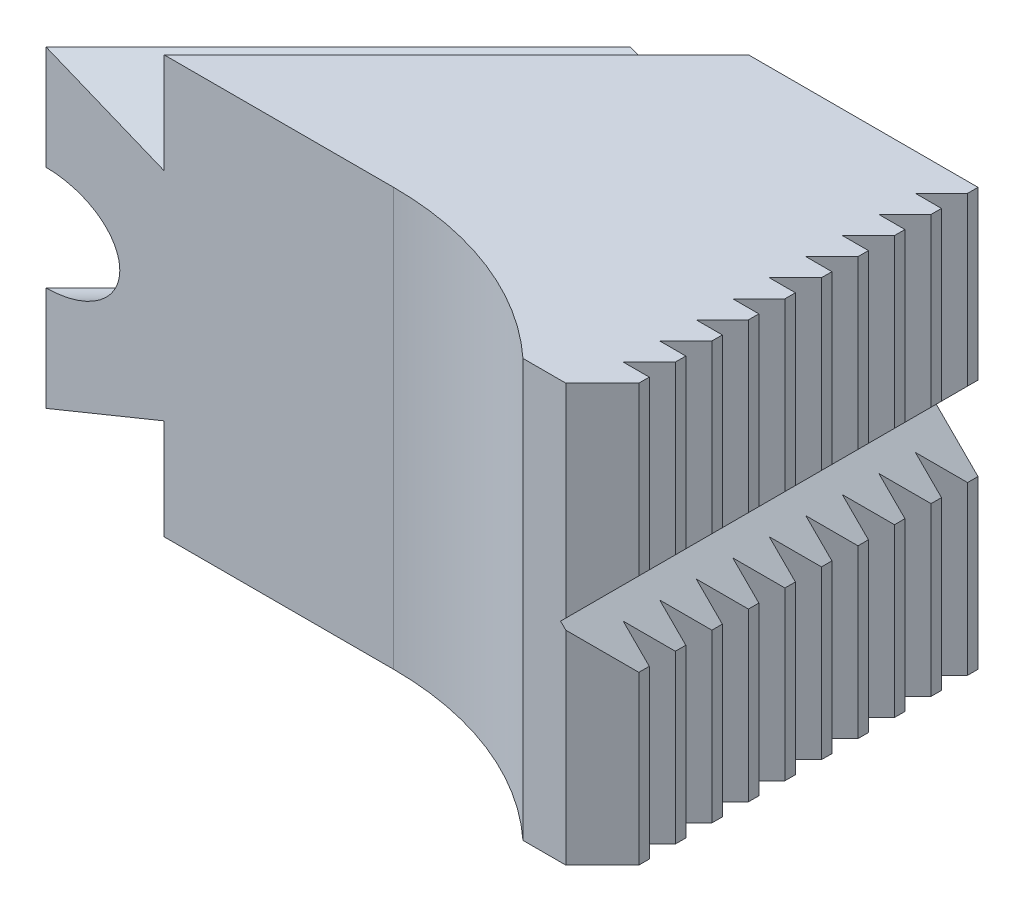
ISO-10303-21;
HEADER;
FILE_DESCRIPTION(('STEP AP214'),'2;1');
FILE_NAME('part.step','',(''),(''),'','','');
FILE_SCHEMA(('AUTOMOTIVE_DESIGN { 1 0 10303 214 1 1 1 1 }'));
ENDSEC;
DATA;
#1=APPLICATION_CONTEXT('core data for automotive mechanical design processes');
#2=APPLICATION_PROTOCOL_DEFINITION('international standard','automotive_design',2000,#1);
#3=PRODUCT_CONTEXT('',#1,'mechanical');
#4=PRODUCT('Part','Part','',(#3));
#5=PRODUCT_RELATED_PRODUCT_CATEGORY('part','',(#4));
#6=PRODUCT_DEFINITION_FORMATION('','',#4);
#7=PRODUCT_DEFINITION_CONTEXT('part definition',#1,'design');
#8=PRODUCT_DEFINITION('design','',#6,#7);
#9=PRODUCT_DEFINITION_SHAPE('','',#8);
#10=(LENGTH_UNIT() NAMED_UNIT(*) SI_UNIT(.MILLI.,.METRE.));
#11=(NAMED_UNIT(*) PLANE_ANGLE_UNIT() SI_UNIT($,.RADIAN.));
#12=(NAMED_UNIT(*) SI_UNIT($,.STERADIAN.) SOLID_ANGLE_UNIT());
#13=UNCERTAINTY_MEASURE_WITH_UNIT(LENGTH_MEASURE(1.E-05),#10,'distance_accuracy_value','');
#14=(GEOMETRIC_REPRESENTATION_CONTEXT(3) GLOBAL_UNCERTAINTY_ASSIGNED_CONTEXT((#13)) GLOBAL_UNIT_ASSIGNED_CONTEXT((#10,
#11,#12)) REPRESENTATION_CONTEXT('',''));
#15=CARTESIAN_POINT('',(0.,0.,0.));
#16=DIRECTION('',(0.,0.,1.));
#17=DIRECTION('',(1.,0.,0.));
#18=AXIS2_PLACEMENT_3D('',#15,#16,#17);
#19=CARTESIAN_POINT('',(-144.75111441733,10.381197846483,156.064822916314));
#20=DIRECTION('',(-0.707106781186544,0.,-0.707106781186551));
#21=DIRECTION('',(0.707106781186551,0.,-0.707106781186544));
#22=AXIS2_PLACEMENT_3D('',#19,#20,#21);
#23=PLANE('',#22);
#24=DIRECTION('',(0.,1.,0.));
#25=VECTOR('',#24,1.);
#26=CARTESIAN_POINT('',(11.3137084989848,20.,0.));
#27=LINE('',#26,#25);
#28=CARTESIAN_POINT('',(11.3137084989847,10.381197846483,0.));
#29=VERTEX_POINT('',#28);
#30=CARTESIAN_POINT('',(11.3137084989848,20.,0.));
#31=VERTEX_POINT('',#30);
#32=EDGE_CURVE('E546',#29,#31,#27,.T.);
#33=ORIENTED_EDGE('',*,*,#32,.F.);
#34=DIRECTION('',(0.707106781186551,0.,-0.707106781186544));
#35=VECTOR('',#34,1.);
#36=CARTESIAN_POINT('',(-144.75111441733,10.381197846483,156.064822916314));
#37=LINE('',#36,#35);
#38=CARTESIAN_POINT('',(-16.6862915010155,10.381197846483,28.));
#39=VERTEX_POINT('',#38);
#40=EDGE_CURVE('E521',#39,#29,#37,.T.);
#41=ORIENTED_EDGE('',*,*,#40,.F.);
#42=DIRECTION('',(0.,-1.,0.));
#43=VECTOR('',#42,1.);
#44=CARTESIAN_POINT('',(-16.6862915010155,20.,28.));
#45=LINE('',#44,#43);
#46=CARTESIAN_POINT('',(-16.6862915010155,20.,28.));
#47=VERTEX_POINT('',#46);
#48=EDGE_CURVE('E543',#47,#39,#45,.T.);
#49=ORIENTED_EDGE('',*,*,#48,.F.);
#50=DIRECTION('',(-0.707106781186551,0.,0.707106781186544));
#51=VECTOR('',#50,1.);
#52=CARTESIAN_POINT('',(-20.6881457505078,20.,32.0018542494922));
#53=LINE('',#52,#51);
#54=EDGE_CURVE('E1061',#31,#47,#53,.T.);
#55=ORIENTED_EDGE('',*,*,#54,.F.);
#56=EDGE_LOOP('',(#33,#41,#49,#55));
#57=FACE_BOUND('',#56,.T.);
#58=ADVANCED_FACE('F14',(#57),#23,.T.);
#59=CARTESIAN_POINT('',(-144.75111441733,10.381197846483,156.064822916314));
#60=DIRECTION('',(0.353553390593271,0.86602540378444,0.353553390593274));
#61=DIRECTION('',(0.,0.377964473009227,-0.925820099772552));
#62=AXIS2_PLACEMENT_3D('',#59,#60,#61);
#63=PLANE('',#62);
#64=DIRECTION('',(0.925820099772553,-0.377964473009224,0.));
#65=VECTOR('',#64,1.);
#66=CARTESIAN_POINT('',(-1.7496355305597,15.7142857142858,0.));
#67=LINE('',#66,#65);
#68=CARTESIAN_POINT('',(0.,15.,0.));
#69=VERTEX_POINT('',#68);
#70=EDGE_CURVE('E508',#69,#29,#67,.T.);
#71=ORIENTED_EDGE('',*,*,#70,.F.);
#72=DIRECTION('',(0.707106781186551,0.,-0.707106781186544));
#73=VECTOR('',#72,1.);
#74=CARTESIAN_POINT('',(-150.407968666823,15.,150.407968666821));
#75=LINE('',#74,#73);
#76=CARTESIAN_POINT('',(-28.,15.,28.));
#77=VERTEX_POINT('',#76);
#78=EDGE_CURVE('E519',#77,#69,#75,.T.);
#79=ORIENTED_EDGE('',*,*,#78,.F.);
#80=DIRECTION('',(-0.925820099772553,0.377964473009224,0.));
#81=VECTOR('',#80,1.);
#82=CARTESIAN_POINT('',(-1.198206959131,4.05821380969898,28.));
#83=LINE('',#82,#81);
#84=EDGE_CURVE('E22',#39,#77,#83,.T.);
#85=ORIENTED_EDGE('',*,*,#84,.F.);
#86=ORIENTED_EDGE('',*,*,#40,.T.);
#87=EDGE_LOOP('',(#71,#79,#85,#86));
#88=FACE_BOUND('',#87,.T.);
#89=ADVANCED_FACE('F517',(#88),#63,.T.);
#90=CARTESIAN_POINT('',(-150.407968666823,0.,150.407968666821));
#91=DIRECTION('',(0.707106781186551,0.,-0.707106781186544));
#92=DIRECTION('',(0.707106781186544,0.,0.707106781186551));
#93=AXIS2_PLACEMENT_3D('',#90,#91,#92);
#94=CYLINDRICAL_SURFACE('',#93,8.9);
#95=DIRECTION('',(0.707106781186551,0.,-0.707106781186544));
#96=VECTOR('',#95,1.);
#97=CARTESIAN_POINT('',(-150.40796864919,8.9,150.407968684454));
#98=LINE('',#97,#96);
#99=CARTESIAN_POINT('',(-19.868272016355,8.9,19.8682720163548));
#100=VERTEX_POINT('',#99);
#101=CARTESIAN_POINT('',(-5.726136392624,8.9,5.72613639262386));
#102=VERTEX_POINT('',#101);
#103=EDGE_CURVE('E526',#100,#102,#98,.T.);
#104=ORIENTED_EDGE('',*,*,#103,.T.);
#105=CARTESIAN_POINT('',(-5.726136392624,0.,5.7261363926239));
#106=DIRECTION('',(-0.707106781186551,0.,0.707106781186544));
#107=DIRECTION('',(-0.707106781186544,0.,-0.707106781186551));
#108=AXIS2_PLACEMENT_3D('',#105,#106,#107);
#109=CIRCLE('',#108,8.9);
#110=CARTESIAN_POINT('',(-5.726136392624,-8.9,5.72613639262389));
#111=VERTEX_POINT('',#110);
#112=EDGE_CURVE('E540',#102,#111,#109,.T.);
#113=ORIENTED_EDGE('',*,*,#112,.T.);
#114=DIRECTION('',(0.707106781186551,0.,-0.707106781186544));
#115=VECTOR('',#114,1.);
#116=CARTESIAN_POINT('',(-150.407968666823,-8.9,150.407968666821));
#117=LINE('',#116,#115);
#118=CARTESIAN_POINT('',(-19.868272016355,-8.9,19.8682720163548));
#119=VERTEX_POINT('',#118);
#120=EDGE_CURVE('E529',#119,#111,#117,.T.);
#121=ORIENTED_EDGE('',*,*,#120,.F.);
#122=CARTESIAN_POINT('',(-19.868272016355,0.,19.8682720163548));
#123=DIRECTION('',(-0.707106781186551,0.,0.707106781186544));
#124=DIRECTION('',(-0.707106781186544,0.,-0.707106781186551));
#125=AXIS2_PLACEMENT_3D('',#122,#123,#124);
#126=CIRCLE('',#125,8.9);
#127=EDGE_CURVE('E1059',#100,#119,#126,.T.);
#128=ORIENTED_EDGE('',*,*,#127,.F.);
#129=EDGE_LOOP('',(#104,#113,#121,#128));
#130=FACE_BOUND('',#129,.T.);
#131=ADVANCED_FACE('F1306',(#130),#94,.T.);
#132=CARTESIAN_POINT('',(-144.75111441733,-10.381197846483,156.064822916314));
#133=DIRECTION('',(-0.707106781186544,0.,-0.707106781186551));
#134=DIRECTION('',(0.707106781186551,0.,-0.707106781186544));
#135=AXIS2_PLACEMENT_3D('',#132,#133,#134);
#136=PLANE('',#135);
#137=DIRECTION('',(0.,1.,0.));
#138=VECTOR('',#137,1.);
#139=CARTESIAN_POINT('',(11.3137084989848,20.,0.));
#140=LINE('',#139,#138);
#141=CARTESIAN_POINT('',(11.3137084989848,-20.,0.));
#142=VERTEX_POINT('',#141);
#143=CARTESIAN_POINT('',(11.3137084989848,-10.381197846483,0.));
#144=VERTEX_POINT('',#143);
#145=EDGE_CURVE('E29',#142,#144,#140,.T.);
#146=ORIENTED_EDGE('',*,*,#145,.F.);
#147=DIRECTION('',(-0.707106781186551,0.,0.707106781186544));
#148=VECTOR('',#147,1.);
#149=CARTESIAN_POINT('',(-20.6881457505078,-20.,32.0018542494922));
#150=LINE('',#149,#148);
#151=CARTESIAN_POINT('',(-16.6862915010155,-20.,28.));
#152=VERTEX_POINT('',#151);
#153=EDGE_CURVE('E1064',#142,#152,#150,.T.);
#154=ORIENTED_EDGE('',*,*,#153,.T.);
#155=DIRECTION('',(0.,-1.,0.));
#156=VECTOR('',#155,1.);
#157=CARTESIAN_POINT('',(-16.6862915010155,20.,28.));
#158=LINE('',#157,#156);
#159=CARTESIAN_POINT('',(-16.6862915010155,-10.381197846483,28.));
#160=VERTEX_POINT('',#159);
#161=EDGE_CURVE('E548',#160,#152,#158,.T.);
#162=ORIENTED_EDGE('',*,*,#161,.F.);
#163=DIRECTION('',(0.707106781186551,0.,-0.707106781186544));
#164=VECTOR('',#163,1.);
#165=CARTESIAN_POINT('',(-144.75111441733,-10.381197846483,156.064822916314));
#166=LINE('',#165,#164);
#167=EDGE_CURVE('E537',#160,#144,#166,.T.);
#168=ORIENTED_EDGE('',*,*,#167,.T.);
#169=EDGE_LOOP('',(#146,#154,#162,#168));
#170=FACE_BOUND('',#169,.T.);
#171=ADVANCED_FACE('F1289',(#170),#136,.T.);
#172=CARTESIAN_POINT('',(-144.75111441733,-10.381197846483,156.064822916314));
#173=DIRECTION('',(0.353553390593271,-0.86602540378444,0.353553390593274));
#174=DIRECTION('',(0.,0.377964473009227,0.925820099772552));
#175=AXIS2_PLACEMENT_3D('',#172,#173,#174);
#176=PLANE('',#175);
#177=DIRECTION('',(-0.925820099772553,-0.377964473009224,0.));
#178=VECTOR('',#177,1.);
#179=CARTESIAN_POINT('',(12.2474487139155,-10.0000000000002,0.));
#180=LINE('',#179,#178);
#181=CARTESIAN_POINT('',(0.,-15.,0.));
#182=VERTEX_POINT('',#181);
#183=EDGE_CURVE('E509',#144,#182,#180,.T.);
#184=ORIENTED_EDGE('',*,*,#183,.F.);
#185=ORIENTED_EDGE('',*,*,#167,.F.);
#186=DIRECTION('',(0.925820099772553,0.377964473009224,0.));
#187=VECTOR('',#186,1.);
#188=CARTESIAN_POINT('',(12.7988772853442,1.65607190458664,28.));
#189=LINE('',#188,#187);
#190=CARTESIAN_POINT('',(-28.0000000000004,-15.,28.));
#191=VERTEX_POINT('',#190);
#192=EDGE_CURVE('E9',#191,#160,#189,.T.);
#193=ORIENTED_EDGE('',*,*,#192,.F.);
#194=DIRECTION('',(0.707106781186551,0.,-0.707106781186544));
#195=VECTOR('',#194,1.);
#196=CARTESIAN_POINT('',(-150.407968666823,-15.,150.407968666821));
#197=LINE('',#196,#195);
#198=EDGE_CURVE('E535',#191,#182,#197,.T.);
#199=ORIENTED_EDGE('',*,*,#198,.T.);
#200=EDGE_LOOP('',(#184,#185,#193,#199));
#201=FACE_BOUND('',#200,.T.);
#202=ADVANCED_FACE('F1293',(#201),#176,.T.);
#203=CARTESIAN_POINT('',(-2.98372437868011E-13,20.,0.));
#204=DIRECTION('',(0.,0.,-1.));
#205=DIRECTION('',(-1.,0.,0.));
#206=AXIS2_PLACEMENT_3D('',#203,#204,#205);
#207=PLANE('',#206);
#208=DIRECTION('',(1.,0.,0.));
#209=VECTOR('',#208,1.);
#210=CARTESIAN_POINT('',(-2.98372437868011E-13,-20.,0.));
#211=LINE('',#210,#209);
#212=CARTESIAN_POINT('',(33.31,-20.,0.));
#213=VERTEX_POINT('',#212);
#214=EDGE_CURVE('E771',#142,#213,#211,.T.);
#215=ORIENTED_EDGE('',*,*,#214,.F.);
#216=ORIENTED_EDGE('',*,*,#145,.T.);
#217=ORIENTED_EDGE('',*,*,#183,.T.);
#218=DIRECTION('',(0.,-1.,0.));
#219=VECTOR('',#218,1.);
#220=CARTESIAN_POINT('',(-2.98372437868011E-13,20.,0.));
#221=LINE('',#220,#219);
#222=EDGE_CURVE('E37',#69,#182,#221,.T.);
#223=ORIENTED_EDGE('',*,*,#222,.F.);
#224=ORIENTED_EDGE('',*,*,#70,.T.);
#225=ORIENTED_EDGE('',*,*,#32,.T.);
#226=DIRECTION('',(1.,0.,0.));
#227=VECTOR('',#226,1.);
#228=CARTESIAN_POINT('',(-2.98372437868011E-13,20.,0.));
#229=LINE('',#228,#227);
#230=CARTESIAN_POINT('',(33.31,20.,0.));
#231=VERTEX_POINT('',#230);
#232=EDGE_CURVE('E868',#31,#231,#229,.T.);
#233=ORIENTED_EDGE('',*,*,#232,.T.);
#234=DIRECTION('',(0.,-1.,0.));
#235=VECTOR('',#234,1.);
#236=CARTESIAN_POINT('',(33.31,20.,0.));
#237=LINE('',#236,#235);
#238=CARTESIAN_POINT('',(33.31,4.00000000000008,0.));
#239=VERTEX_POINT('',#238);
#240=EDGE_CURVE('E873',#231,#239,#237,.T.);
#241=ORIENTED_EDGE('',*,*,#240,.T.);
#242=DIRECTION('',(-0.707106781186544,-0.707106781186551,0.));
#243=VECTOR('',#242,1.);
#244=CARTESIAN_POINT('',(33.31,4.00000000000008,0.));
#245=LINE('',#244,#243);
#246=CARTESIAN_POINT('',(29.31,0.,0.));
#247=VERTEX_POINT('',#246);
#248=EDGE_CURVE('E553',#239,#247,#245,.T.);
#249=ORIENTED_EDGE('',*,*,#248,.T.);
#250=DIRECTION('',(-0.707106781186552,0.707106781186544,0.));
#251=VECTOR('',#250,1.);
#252=CARTESIAN_POINT('',(33.31,-4.,0.));
#253=LINE('',#252,#251);
#254=CARTESIAN_POINT('',(33.31,-4.,0.));
#255=VERTEX_POINT('',#254);
#256=EDGE_CURVE('E554',#255,#247,#253,.T.);
#257=ORIENTED_EDGE('',*,*,#256,.F.);
#258=EDGE_CURVE('E511',#255,#213,#237,.T.);
#259=ORIENTED_EDGE('',*,*,#258,.T.);
#260=EDGE_LOOP('',(#215,#216,#217,#223,#224,#225,#233,#241,#249,#257,#259));
#261=FACE_BOUND('',#260,.T.);
#262=ADVANCED_FACE('F506',(#261),#207,.T.);
#263=CARTESIAN_POINT('',(5.3099999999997,20.,28.));
#264=DIRECTION('',(0.,0.,1.));
#265=DIRECTION('',(1.,0.,0.));
#266=AXIS2_PLACEMENT_3D('',#263,#264,#265);
#267=PLANE('',#266);
#268=ORIENTED_EDGE('',*,*,#192,.T.);
#269=ORIENTED_EDGE('',*,*,#161,.T.);
#270=DIRECTION('',(-1.,0.,0.));
#271=VECTOR('',#270,1.);
#272=CARTESIAN_POINT('',(5.3099999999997,-20.,28.));
#273=LINE('',#272,#271);
#274=CARTESIAN_POINT('',(5.3099999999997,-20.,28.));
#275=VERTEX_POINT('',#274);
#276=EDGE_CURVE('E676',#275,#152,#273,.T.);
#277=ORIENTED_EDGE('',*,*,#276,.F.);
#278=DIRECTION('',(0.,-1.,0.));
#279=VECTOR('',#278,1.);
#280=CARTESIAN_POINT('',(5.3099999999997,20.,28.));
#281=LINE('',#280,#279);
#282=CARTESIAN_POINT('',(5.3099999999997,20.,28.));
#283=VERTEX_POINT('',#282);
#284=EDGE_CURVE('E994',#283,#275,#281,.T.);
#285=ORIENTED_EDGE('',*,*,#284,.F.);
#286=DIRECTION('',(-1.,0.,0.));
#287=VECTOR('',#286,1.);
#288=CARTESIAN_POINT('',(5.3099999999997,20.,28.));
#289=LINE('',#288,#287);
#290=EDGE_CURVE('E680',#283,#47,#289,.T.);
#291=ORIENTED_EDGE('',*,*,#290,.T.);
#292=ORIENTED_EDGE('',*,*,#48,.T.);
#293=ORIENTED_EDGE('',*,*,#84,.T.);
#294=DIRECTION('',(0.,-1.,0.));
#295=VECTOR('',#294,1.);
#296=CARTESIAN_POINT('',(-28.0000000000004,20.,28.));
#297=LINE('',#296,#295);
#298=CARTESIAN_POINT('',(-28.0000000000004,5.,28.));
#299=VERTEX_POINT('',#298);
#300=EDGE_CURVE('E512',#77,#299,#297,.T.);
#301=ORIENTED_EDGE('',*,*,#300,.T.);
#302=CARTESIAN_POINT('',(-28.0000000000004,0.,28.));
#303=DIRECTION('',(0.,0.,1.));
#304=DIRECTION('',(-1.,0.,0.));
#305=AXIS2_PLACEMENT_3D('',#302,#303,#304);
#306=ELLIPSE('',#305,7.07106781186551,5.);
#307=CARTESIAN_POINT('',(-28.0000000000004,-5.,28.));
#308=VERTEX_POINT('',#307);
#309=EDGE_CURVE('E673',#308,#299,#306,.T.);
#310=ORIENTED_EDGE('',*,*,#309,.F.);
#311=EDGE_CURVE('E777',#308,#191,#297,.T.);
#312=ORIENTED_EDGE('',*,*,#311,.T.);
#313=EDGE_LOOP('',(#268,#269,#277,#285,#291,#292,#293,#301,#310,#312));
#314=FACE_BOUND('',#313,.T.);
#315=ADVANCED_FACE('F1067',(#314),#267,.T.);
#316=CARTESIAN_POINT('',(5.3099999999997,-20.,58.));
#317=DIRECTION('',(0.,1.,0.));
#318=DIRECTION('',(0.,0.,1.));
#319=AXIS2_PLACEMENT_3D('',#316,#317,#318);
#320=PLANE('',#319);
#321=ORIENTED_EDGE('',*,*,#153,.F.);
#322=ORIENTED_EDGE('',*,*,#214,.T.);
#323=DIRECTION('',(0.,0.,-1.));
#324=VECTOR('',#323,1.);
#325=CARTESIAN_POINT('',(33.31,-20.,1.));
#326=LINE('',#325,#324);
#327=CARTESIAN_POINT('',(33.31,-20.,1.));
#328=VERTEX_POINT('',#327);
#329=EDGE_CURVE('E768',#328,#213,#326,.T.);
#330=ORIENTED_EDGE('',*,*,#329,.F.);
#331=DIRECTION('',(-0.707106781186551,0.,0.707106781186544));
#332=VECTOR('',#331,1.);
#333=CARTESIAN_POINT('',(33.31,-20.,1.));
#334=LINE('',#333,#332);
#335=CARTESIAN_POINT('',(30.81,-20.,3.5));
#336=VERTEX_POINT('',#335);
#337=EDGE_CURVE('E765',#328,#336,#334,.T.);
#338=ORIENTED_EDGE('',*,*,#337,.T.);
#339=DIRECTION('',(-1.,0.,0.));
#340=VECTOR('',#339,1.);
#341=CARTESIAN_POINT('',(33.31,-20.,3.5));
#342=LINE('',#341,#340);
#343=CARTESIAN_POINT('',(33.31,-20.,3.5));
#344=VERTEX_POINT('',#343);
#345=EDGE_CURVE('E762',#344,#336,#342,.T.);
#346=ORIENTED_EDGE('',*,*,#345,.F.);
#347=DIRECTION('',(0.,0.,-1.));
#348=VECTOR('',#347,1.);
#349=CARTESIAN_POINT('',(33.31,-20.,4.5));
#350=LINE('',#349,#348);
#351=CARTESIAN_POINT('',(33.31,-20.,4.5));
#352=VERTEX_POINT('',#351);
#353=EDGE_CURVE('E759',#352,#344,#350,.T.);
#354=ORIENTED_EDGE('',*,*,#353,.F.);
#355=DIRECTION('',(-0.707106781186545,0.,0.70710678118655));
#356=VECTOR('',#355,1.);
#357=CARTESIAN_POINT('',(33.31,-20.,4.5));
#358=LINE('',#357,#356);
#359=CARTESIAN_POINT('',(30.81,-20.,7.));
#360=VERTEX_POINT('',#359);
#361=EDGE_CURVE('E756',#352,#360,#358,.T.);
#362=ORIENTED_EDGE('',*,*,#361,.T.);
#363=DIRECTION('',(-1.,0.,0.));
#364=VECTOR('',#363,1.);
#365=CARTESIAN_POINT('',(33.31,-20.,7.));
#366=LINE('',#365,#364);
#367=CARTESIAN_POINT('',(33.31,-20.,7.));
#368=VERTEX_POINT('',#367);
#369=EDGE_CURVE('E753',#368,#360,#366,.T.);
#370=ORIENTED_EDGE('',*,*,#369,.F.);
#371=DIRECTION('',(0.,0.,-1.));
#372=VECTOR('',#371,1.);
#373=CARTESIAN_POINT('',(33.31,-20.,8.));
#374=LINE('',#373,#372);
#375=CARTESIAN_POINT('',(33.31,-20.,8.));
#376=VERTEX_POINT('',#375);
#377=EDGE_CURVE('E750',#376,#368,#374,.T.);
#378=ORIENTED_EDGE('',*,*,#377,.F.);
#379=DIRECTION('',(-0.707106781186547,0.,0.707106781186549));
#380=VECTOR('',#379,1.);
#381=CARTESIAN_POINT('',(33.31,-20.,8.));
#382=LINE('',#381,#380);
#383=CARTESIAN_POINT('',(30.81,-20.,10.5));
#384=VERTEX_POINT('',#383);
#385=EDGE_CURVE('E747',#376,#384,#382,.T.);
#386=ORIENTED_EDGE('',*,*,#385,.T.);
#387=DIRECTION('',(-1.,0.,0.));
#388=VECTOR('',#387,1.);
#389=CARTESIAN_POINT('',(33.31,-20.,10.5));
#390=LINE('',#389,#388);
#391=CARTESIAN_POINT('',(33.31,-20.,10.5));
#392=VERTEX_POINT('',#391);
#393=EDGE_CURVE('E744',#392,#384,#390,.T.);
#394=ORIENTED_EDGE('',*,*,#393,.F.);
#395=DIRECTION('',(0.,0.,-1.));
#396=VECTOR('',#395,1.);
#397=CARTESIAN_POINT('',(33.31,-20.,11.5));
#398=LINE('',#397,#396);
#399=CARTESIAN_POINT('',(33.31,-20.,11.5));
#400=VERTEX_POINT('',#399);
#401=EDGE_CURVE('E741',#400,#392,#398,.T.);
#402=ORIENTED_EDGE('',*,*,#401,.F.);
#403=DIRECTION('',(-0.707106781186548,0.,0.707106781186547));
#404=VECTOR('',#403,1.);
#405=CARTESIAN_POINT('',(33.31,-20.,11.5));
#406=LINE('',#405,#404);
#407=CARTESIAN_POINT('',(30.81,-20.,14.));
#408=VERTEX_POINT('',#407);
#409=EDGE_CURVE('E738',#400,#408,#406,.T.);
#410=ORIENTED_EDGE('',*,*,#409,.T.);
#411=DIRECTION('',(-1.,0.,0.));
#412=VECTOR('',#411,1.);
#413=CARTESIAN_POINT('',(33.31,-20.,14.));
#414=LINE('',#413,#412);
#415=CARTESIAN_POINT('',(33.31,-20.,14.));
#416=VERTEX_POINT('',#415);
#417=EDGE_CURVE('E735',#416,#408,#414,.T.);
#418=ORIENTED_EDGE('',*,*,#417,.F.);
#419=DIRECTION('',(0.,0.,-1.));
#420=VECTOR('',#419,1.);
#421=CARTESIAN_POINT('',(33.31,-20.,15.));
#422=LINE('',#421,#420);
#423=CARTESIAN_POINT('',(33.31,-20.,15.));
#424=VERTEX_POINT('',#423);
#425=EDGE_CURVE('E732',#424,#416,#422,.T.);
#426=ORIENTED_EDGE('',*,*,#425,.F.);
#427=DIRECTION('',(-0.707106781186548,0.,0.707106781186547));
#428=VECTOR('',#427,1.);
#429=CARTESIAN_POINT('',(33.31,-20.,15.));
#430=LINE('',#429,#428);
#431=CARTESIAN_POINT('',(30.81,-20.,17.5));
#432=VERTEX_POINT('',#431);
#433=EDGE_CURVE('E729',#424,#432,#430,.T.);
#434=ORIENTED_EDGE('',*,*,#433,.T.);
#435=DIRECTION('',(-1.,0.,0.));
#436=VECTOR('',#435,1.);
#437=CARTESIAN_POINT('',(33.31,-20.,17.5));
#438=LINE('',#437,#436);
#439=CARTESIAN_POINT('',(33.31,-20.,17.5));
#440=VERTEX_POINT('',#439);
#441=EDGE_CURVE('E726',#440,#432,#438,.T.);
#442=ORIENTED_EDGE('',*,*,#441,.F.);
#443=DIRECTION('',(0.,0.,-1.));
#444=VECTOR('',#443,1.);
#445=CARTESIAN_POINT('',(33.31,-20.,18.5));
#446=LINE('',#445,#444);
#447=CARTESIAN_POINT('',(33.31,-20.,18.5));
#448=VERTEX_POINT('',#447);
#449=EDGE_CURVE('E723',#448,#440,#446,.T.);
#450=ORIENTED_EDGE('',*,*,#449,.F.);
#451=DIRECTION('',(-0.707106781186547,0.,0.707106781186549));
#452=VECTOR('',#451,1.);
#453=CARTESIAN_POINT('',(33.31,-20.,18.5));
#454=LINE('',#453,#452);
#455=CARTESIAN_POINT('',(30.81,-20.,21.));
#456=VERTEX_POINT('',#455);
#457=EDGE_CURVE('E720',#448,#456,#454,.T.);
#458=ORIENTED_EDGE('',*,*,#457,.T.);
#459=DIRECTION('',(-1.,0.,0.));
#460=VECTOR('',#459,1.);
#461=CARTESIAN_POINT('',(33.31,-20.,21.));
#462=LINE('',#461,#460);
#463=CARTESIAN_POINT('',(33.31,-20.,21.));
#464=VERTEX_POINT('',#463);
#465=EDGE_CURVE('E717',#464,#456,#462,.T.);
#466=ORIENTED_EDGE('',*,*,#465,.F.);
#467=DIRECTION('',(0.,0.,-1.));
#468=VECTOR('',#467,1.);
#469=CARTESIAN_POINT('',(33.31,-20.,22.));
#470=LINE('',#469,#468);
#471=CARTESIAN_POINT('',(33.31,-20.,22.));
#472=VERTEX_POINT('',#471);
#473=EDGE_CURVE('E714',#472,#464,#470,.T.);
#474=ORIENTED_EDGE('',*,*,#473,.F.);
#475=DIRECTION('',(-0.707106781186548,0.,0.707106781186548));
#476=VECTOR('',#475,1.);
#477=CARTESIAN_POINT('',(33.31,-20.,22.));
#478=LINE('',#477,#476);
#479=CARTESIAN_POINT('',(30.81,-20.,24.5));
#480=VERTEX_POINT('',#479);
#481=EDGE_CURVE('E711',#472,#480,#478,.T.);
#482=ORIENTED_EDGE('',*,*,#481,.T.);
#483=DIRECTION('',(-1.,0.,0.));
#484=VECTOR('',#483,1.);
#485=CARTESIAN_POINT('',(33.31,-20.,24.5));
#486=LINE('',#485,#484);
#487=CARTESIAN_POINT('',(33.31,-20.,24.5));
#488=VERTEX_POINT('',#487);
#489=EDGE_CURVE('E708',#488,#480,#486,.T.);
#490=ORIENTED_EDGE('',*,*,#489,.F.);
#491=DIRECTION('',(0.,0.,-1.));
#492=VECTOR('',#491,1.);
#493=CARTESIAN_POINT('',(33.31,-20.,25.5));
#494=LINE('',#493,#492);
#495=CARTESIAN_POINT('',(33.31,-20.,25.5));
#496=VERTEX_POINT('',#495);
#497=EDGE_CURVE('E705',#496,#488,#494,.T.);
#498=ORIENTED_EDGE('',*,*,#497,.F.);
#499=DIRECTION('',(-0.70710678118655,0.,0.707106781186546));
#500=VECTOR('',#499,1.);
#501=CARTESIAN_POINT('',(33.31,-20.,25.5));
#502=LINE('',#501,#500);
#503=CARTESIAN_POINT('',(30.81,-20.,28.));
#504=VERTEX_POINT('',#503);
#505=EDGE_CURVE('E702',#496,#504,#502,.T.);
#506=ORIENTED_EDGE('',*,*,#505,.T.);
#507=DIRECTION('',(-1.,0.,0.));
#508=VECTOR('',#507,1.);
#509=CARTESIAN_POINT('',(33.31,-20.,28.));
#510=LINE('',#509,#508);
#511=CARTESIAN_POINT('',(33.31,-20.,28.));
#512=VERTEX_POINT('',#511);
#513=EDGE_CURVE('E699',#512,#504,#510,.T.);
#514=ORIENTED_EDGE('',*,*,#513,.F.);
#515=DIRECTION('',(0.,0.,-1.));
#516=VECTOR('',#515,1.);
#517=CARTESIAN_POINT('',(33.31,-20.,29.));
#518=LINE('',#517,#516);
#519=CARTESIAN_POINT('',(33.31,-20.,29.));
#520=VERTEX_POINT('',#519);
#521=EDGE_CURVE('E696',#520,#512,#518,.T.);
#522=ORIENTED_EDGE('',*,*,#521,.F.);
#523=DIRECTION('',(-0.707106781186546,0.,0.707106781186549));
#524=VECTOR('',#523,1.);
#525=CARTESIAN_POINT('',(33.31,-20.,29.));
#526=LINE('',#525,#524);
#527=CARTESIAN_POINT('',(30.81,-20.,31.5));
#528=VERTEX_POINT('',#527);
#529=EDGE_CURVE('E693',#520,#528,#526,.T.);
#530=ORIENTED_EDGE('',*,*,#529,.T.);
#531=DIRECTION('',(-1.,0.,0.));
#532=VECTOR('',#531,1.);
#533=CARTESIAN_POINT('',(33.31,-20.,31.5));
#534=LINE('',#533,#532);
#535=CARTESIAN_POINT('',(33.31,-20.,31.5));
#536=VERTEX_POINT('',#535);
#537=EDGE_CURVE('E690',#536,#528,#534,.T.);
#538=ORIENTED_EDGE('',*,*,#537,.F.);
#539=DIRECTION('',(0.,0.,-1.));
#540=VECTOR('',#539,1.);
#541=CARTESIAN_POINT('',(33.31,-20.,32.5));
#542=LINE('',#541,#540);
#543=CARTESIAN_POINT('',(33.31,-20.,32.5));
#544=VERTEX_POINT('',#543);
#545=EDGE_CURVE('E687',#544,#536,#542,.T.);
#546=ORIENTED_EDGE('',*,*,#545,.F.);
#547=DIRECTION('',(-0.707106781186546,0.,0.70710678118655));
#548=VECTOR('',#547,1.);
#549=CARTESIAN_POINT('',(33.31,-20.,32.5));
#550=LINE('',#549,#548);
#551=CARTESIAN_POINT('',(29.81,-20.,36.));
#552=VERTEX_POINT('',#551);
#553=EDGE_CURVE('E684',#544,#552,#550,.T.);
#554=ORIENTED_EDGE('',*,*,#553,.T.);
#555=DIRECTION('',(-1.,0.,0.));
#556=VECTOR('',#555,1.);
#557=CARTESIAN_POINT('',(29.81,-20.,36.));
#558=LINE('',#557,#556);
#559=CARTESIAN_POINT('',(25.7060780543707,-20.,36.));
#560=VERTEX_POINT('',#559);
#561=EDGE_CURVE('E681',#552,#560,#558,.T.);
#562=ORIENTED_EDGE('',*,*,#561,.T.);
#563=CARTESIAN_POINT('',(5.3099999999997,-20.,58.));
#564=DIRECTION('',(0.,1.,0.));
#565=DIRECTION('',(0.,0.,1.));
#566=AXIS2_PLACEMENT_3D('',#563,#564,#565);
#567=CIRCLE('',#566,30.);
#568=EDGE_CURVE('E677',#560,#275,#567,.T.);
#569=ORIENTED_EDGE('',*,*,#568,.T.);
#570=ORIENTED_EDGE('',*,*,#276,.T.);
#571=EDGE_LOOP('',(#321,#322,#330,#338,#346,#354,#362,#370,#378,#386,#394,#402,#410,#418,#426,
#434,#442,#450,#458,#466,#474,#482,#490,#498,#506,#514,#522,#530,#538,#546,#554,#562,#569,#570));
#572=FACE_BOUND('',#571,.T.);
#573=ADVANCED_FACE('F1155',(#572),#320,.F.);
#574=CARTESIAN_POINT('',(5.3099999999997,20.,58.));
#575=DIRECTION('',(0.,1.,0.));
#576=DIRECTION('',(0.,0.,1.));
#577=AXIS2_PLACEMENT_3D('',#574,#575,#576);
#578=PLANE('',#577);
#579=ORIENTED_EDGE('',*,*,#232,.F.);
#580=ORIENTED_EDGE('',*,*,#54,.T.);
#581=ORIENTED_EDGE('',*,*,#290,.F.);
#582=CARTESIAN_POINT('',(5.3099999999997,20.,58.));
#583=DIRECTION('',(0.,1.,0.));
#584=DIRECTION('',(0.,0.,1.));
#585=AXIS2_PLACEMENT_3D('',#582,#583,#584);
#586=CIRCLE('',#585,30.);
#587=CARTESIAN_POINT('',(25.7060780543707,20.,36.));
#588=VERTEX_POINT('',#587);
#589=EDGE_CURVE('E774',#588,#283,#586,.T.);
#590=ORIENTED_EDGE('',*,*,#589,.F.);
#591=DIRECTION('',(-1.,0.,0.));
#592=VECTOR('',#591,1.);
#593=CARTESIAN_POINT('',(29.81,20.,36.));
#594=LINE('',#593,#592);
#595=CARTESIAN_POINT('',(29.81,20.,36.));
#596=VERTEX_POINT('',#595);
#597=EDGE_CURVE('E778',#596,#588,#594,.T.);
#598=ORIENTED_EDGE('',*,*,#597,.F.);
#599=DIRECTION('',(-0.707106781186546,0.,0.70710678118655));
#600=VECTOR('',#599,1.);
#601=CARTESIAN_POINT('',(33.31,20.,32.5));
#602=LINE('',#601,#600);
#603=CARTESIAN_POINT('',(33.31,20.,32.5));
#604=VERTEX_POINT('',#603);
#605=EDGE_CURVE('E781',#604,#596,#602,.T.);
#606=ORIENTED_EDGE('',*,*,#605,.F.);
#607=DIRECTION('',(0.,0.,-1.));
#608=VECTOR('',#607,1.);
#609=CARTESIAN_POINT('',(33.31,20.,32.5));
#610=LINE('',#609,#608);
#611=CARTESIAN_POINT('',(33.31,20.,31.5));
#612=VERTEX_POINT('',#611);
#613=EDGE_CURVE('E784',#604,#612,#610,.T.);
#614=ORIENTED_EDGE('',*,*,#613,.T.);
#615=DIRECTION('',(-1.,0.,0.));
#616=VECTOR('',#615,1.);
#617=CARTESIAN_POINT('',(33.31,20.,31.5));
#618=LINE('',#617,#616);
#619=CARTESIAN_POINT('',(30.81,20.,31.5));
#620=VERTEX_POINT('',#619);
#621=EDGE_CURVE('E787',#612,#620,#618,.T.);
#622=ORIENTED_EDGE('',*,*,#621,.T.);
#623=DIRECTION('',(-0.707106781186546,0.,0.707106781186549));
#624=VECTOR('',#623,1.);
#625=CARTESIAN_POINT('',(33.31,20.,29.));
#626=LINE('',#625,#624);
#627=CARTESIAN_POINT('',(33.31,20.,29.));
#628=VERTEX_POINT('',#627);
#629=EDGE_CURVE('E790',#628,#620,#626,.T.);
#630=ORIENTED_EDGE('',*,*,#629,.F.);
#631=DIRECTION('',(0.,0.,-1.));
#632=VECTOR('',#631,1.);
#633=CARTESIAN_POINT('',(33.31,20.,29.));
#634=LINE('',#633,#632);
#635=CARTESIAN_POINT('',(33.31,20.,28.));
#636=VERTEX_POINT('',#635);
#637=EDGE_CURVE('E793',#628,#636,#634,.T.);
#638=ORIENTED_EDGE('',*,*,#637,.T.);
#639=DIRECTION('',(-1.,0.,0.));
#640=VECTOR('',#639,1.);
#641=CARTESIAN_POINT('',(33.31,20.,28.));
#642=LINE('',#641,#640);
#643=CARTESIAN_POINT('',(30.81,20.,28.));
#644=VERTEX_POINT('',#643);
#645=EDGE_CURVE('E796',#636,#644,#642,.T.);
#646=ORIENTED_EDGE('',*,*,#645,.T.);
#647=DIRECTION('',(-0.70710678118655,0.,0.707106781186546));
#648=VECTOR('',#647,1.);
#649=CARTESIAN_POINT('',(33.31,20.,25.5));
#650=LINE('',#649,#648);
#651=CARTESIAN_POINT('',(33.31,20.,25.5));
#652=VERTEX_POINT('',#651);
#653=EDGE_CURVE('E799',#652,#644,#650,.T.);
#654=ORIENTED_EDGE('',*,*,#653,.F.);
#655=DIRECTION('',(0.,0.,-1.));
#656=VECTOR('',#655,1.);
#657=CARTESIAN_POINT('',(33.31,20.,25.5));
#658=LINE('',#657,#656);
#659=CARTESIAN_POINT('',(33.31,20.,24.5));
#660=VERTEX_POINT('',#659);
#661=EDGE_CURVE('E802',#652,#660,#658,.T.);
#662=ORIENTED_EDGE('',*,*,#661,.T.);
#663=DIRECTION('',(-1.,0.,0.));
#664=VECTOR('',#663,1.);
#665=CARTESIAN_POINT('',(33.31,20.,24.5));
#666=LINE('',#665,#664);
#667=CARTESIAN_POINT('',(30.81,20.,24.5));
#668=VERTEX_POINT('',#667);
#669=EDGE_CURVE('E805',#660,#668,#666,.T.);
#670=ORIENTED_EDGE('',*,*,#669,.T.);
#671=DIRECTION('',(-0.707106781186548,0.,0.707106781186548));
#672=VECTOR('',#671,1.);
#673=CARTESIAN_POINT('',(33.31,20.,22.));
#674=LINE('',#673,#672);
#675=CARTESIAN_POINT('',(33.31,20.,22.));
#676=VERTEX_POINT('',#675);
#677=EDGE_CURVE('E808',#676,#668,#674,.T.);
#678=ORIENTED_EDGE('',*,*,#677,.F.);
#679=DIRECTION('',(0.,0.,-1.));
#680=VECTOR('',#679,1.);
#681=CARTESIAN_POINT('',(33.31,20.,22.));
#682=LINE('',#681,#680);
#683=CARTESIAN_POINT('',(33.31,20.,21.));
#684=VERTEX_POINT('',#683);
#685=EDGE_CURVE('E811',#676,#684,#682,.T.);
#686=ORIENTED_EDGE('',*,*,#685,.T.);
#687=DIRECTION('',(-1.,0.,0.));
#688=VECTOR('',#687,1.);
#689=CARTESIAN_POINT('',(33.31,20.,21.));
#690=LINE('',#689,#688);
#691=CARTESIAN_POINT('',(30.81,20.,21.));
#692=VERTEX_POINT('',#691);
#693=EDGE_CURVE('E814',#684,#692,#690,.T.);
#694=ORIENTED_EDGE('',*,*,#693,.T.);
#695=DIRECTION('',(-0.707106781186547,0.,0.707106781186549));
#696=VECTOR('',#695,1.);
#697=CARTESIAN_POINT('',(33.31,20.,18.5));
#698=LINE('',#697,#696);
#699=CARTESIAN_POINT('',(33.31,20.,18.5));
#700=VERTEX_POINT('',#699);
#701=EDGE_CURVE('E817',#700,#692,#698,.T.);
#702=ORIENTED_EDGE('',*,*,#701,.F.);
#703=DIRECTION('',(0.,0.,-1.));
#704=VECTOR('',#703,1.);
#705=CARTESIAN_POINT('',(33.31,20.,18.5));
#706=LINE('',#705,#704);
#707=CARTESIAN_POINT('',(33.31,20.,17.5));
#708=VERTEX_POINT('',#707);
#709=EDGE_CURVE('E820',#700,#708,#706,.T.);
#710=ORIENTED_EDGE('',*,*,#709,.T.);
#711=DIRECTION('',(-1.,0.,0.));
#712=VECTOR('',#711,1.);
#713=CARTESIAN_POINT('',(33.31,20.,17.5));
#714=LINE('',#713,#712);
#715=CARTESIAN_POINT('',(30.81,20.,17.5));
#716=VERTEX_POINT('',#715);
#717=EDGE_CURVE('E823',#708,#716,#714,.T.);
#718=ORIENTED_EDGE('',*,*,#717,.T.);
#719=DIRECTION('',(-0.707106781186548,0.,0.707106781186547));
#720=VECTOR('',#719,1.);
#721=CARTESIAN_POINT('',(33.31,20.,15.));
#722=LINE('',#721,#720);
#723=CARTESIAN_POINT('',(33.31,20.,15.));
#724=VERTEX_POINT('',#723);
#725=EDGE_CURVE('E826',#724,#716,#722,.T.);
#726=ORIENTED_EDGE('',*,*,#725,.F.);
#727=DIRECTION('',(0.,0.,-1.));
#728=VECTOR('',#727,1.);
#729=CARTESIAN_POINT('',(33.31,20.,15.));
#730=LINE('',#729,#728);
#731=CARTESIAN_POINT('',(33.31,20.,14.));
#732=VERTEX_POINT('',#731);
#733=EDGE_CURVE('E829',#724,#732,#730,.T.);
#734=ORIENTED_EDGE('',*,*,#733,.T.);
#735=DIRECTION('',(-1.,0.,0.));
#736=VECTOR('',#735,1.);
#737=CARTESIAN_POINT('',(33.31,20.,14.));
#738=LINE('',#737,#736);
#739=CARTESIAN_POINT('',(30.81,20.,14.));
#740=VERTEX_POINT('',#739);
#741=EDGE_CURVE('E832',#732,#740,#738,.T.);
#742=ORIENTED_EDGE('',*,*,#741,.T.);
#743=DIRECTION('',(-0.707106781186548,0.,0.707106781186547));
#744=VECTOR('',#743,1.);
#745=CARTESIAN_POINT('',(33.31,20.,11.5));
#746=LINE('',#745,#744);
#747=CARTESIAN_POINT('',(33.31,20.,11.5));
#748=VERTEX_POINT('',#747);
#749=EDGE_CURVE('E835',#748,#740,#746,.T.);
#750=ORIENTED_EDGE('',*,*,#749,.F.);
#751=DIRECTION('',(0.,0.,-1.));
#752=VECTOR('',#751,1.);
#753=CARTESIAN_POINT('',(33.31,20.,11.5));
#754=LINE('',#753,#752);
#755=CARTESIAN_POINT('',(33.31,20.,10.5));
#756=VERTEX_POINT('',#755);
#757=EDGE_CURVE('E838',#748,#756,#754,.T.);
#758=ORIENTED_EDGE('',*,*,#757,.T.);
#759=DIRECTION('',(-1.,0.,0.));
#760=VECTOR('',#759,1.);
#761=CARTESIAN_POINT('',(33.31,20.,10.5));
#762=LINE('',#761,#760);
#763=CARTESIAN_POINT('',(30.81,20.,10.5));
#764=VERTEX_POINT('',#763);
#765=EDGE_CURVE('E841',#756,#764,#762,.T.);
#766=ORIENTED_EDGE('',*,*,#765,.T.);
#767=DIRECTION('',(-0.707106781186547,0.,0.707106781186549));
#768=VECTOR('',#767,1.);
#769=CARTESIAN_POINT('',(33.31,20.,8.));
#770=LINE('',#769,#768);
#771=CARTESIAN_POINT('',(33.31,20.,8.));
#772=VERTEX_POINT('',#771);
#773=EDGE_CURVE('E844',#772,#764,#770,.T.);
#774=ORIENTED_EDGE('',*,*,#773,.F.);
#775=DIRECTION('',(0.,0.,-1.));
#776=VECTOR('',#775,1.);
#777=CARTESIAN_POINT('',(33.31,20.,8.));
#778=LINE('',#777,#776);
#779=CARTESIAN_POINT('',(33.31,20.,7.));
#780=VERTEX_POINT('',#779);
#781=EDGE_CURVE('E847',#772,#780,#778,.T.);
#782=ORIENTED_EDGE('',*,*,#781,.T.);
#783=DIRECTION('',(-1.,0.,0.));
#784=VECTOR('',#783,1.);
#785=CARTESIAN_POINT('',(33.31,20.,7.));
#786=LINE('',#785,#784);
#787=CARTESIAN_POINT('',(30.81,20.,7.));
#788=VERTEX_POINT('',#787);
#789=EDGE_CURVE('E850',#780,#788,#786,.T.);
#790=ORIENTED_EDGE('',*,*,#789,.T.);
#791=DIRECTION('',(-0.707106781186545,0.,0.70710678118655));
#792=VECTOR('',#791,1.);
#793=CARTESIAN_POINT('',(33.31,20.,4.5));
#794=LINE('',#793,#792);
#795=CARTESIAN_POINT('',(33.31,20.,4.5));
#796=VERTEX_POINT('',#795);
#797=EDGE_CURVE('E853',#796,#788,#794,.T.);
#798=ORIENTED_EDGE('',*,*,#797,.F.);
#799=DIRECTION('',(0.,0.,-1.));
#800=VECTOR('',#799,1.);
#801=CARTESIAN_POINT('',(33.31,20.,4.5));
#802=LINE('',#801,#800);
#803=CARTESIAN_POINT('',(33.31,20.,3.5));
#804=VERTEX_POINT('',#803);
#805=EDGE_CURVE('E856',#796,#804,#802,.T.);
#806=ORIENTED_EDGE('',*,*,#805,.T.);
#807=DIRECTION('',(-1.,0.,0.));
#808=VECTOR('',#807,1.);
#809=CARTESIAN_POINT('',(33.31,20.,3.5));
#810=LINE('',#809,#808);
#811=CARTESIAN_POINT('',(30.81,20.,3.5));
#812=VERTEX_POINT('',#811);
#813=EDGE_CURVE('E859',#804,#812,#810,.T.);
#814=ORIENTED_EDGE('',*,*,#813,.T.);
#815=DIRECTION('',(-0.707106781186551,0.,0.707106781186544));
#816=VECTOR('',#815,1.);
#817=CARTESIAN_POINT('',(33.31,20.,1.));
#818=LINE('',#817,#816);
#819=CARTESIAN_POINT('',(33.31,20.,1.));
#820=VERTEX_POINT('',#819);
#821=EDGE_CURVE('E862',#820,#812,#818,.T.);
#822=ORIENTED_EDGE('',*,*,#821,.F.);
#823=DIRECTION('',(0.,0.,-1.));
#824=VECTOR('',#823,1.);
#825=CARTESIAN_POINT('',(33.31,20.,1.));
#826=LINE('',#825,#824);
#827=EDGE_CURVE('E865',#820,#231,#826,.T.);
#828=ORIENTED_EDGE('',*,*,#827,.T.);
#829=EDGE_LOOP('',(#579,#580,#581,#590,#598,#606,#614,#622,#630,#638,#646,#654,#662,#670,#678,
#686,#694,#702,#710,#718,#726,#734,#742,#750,#758,#766,#774,#782,#790,#798,#806,#814,#822,#828));
#830=FACE_BOUND('',#829,.T.);
#831=ADVANCED_FACE('F1073',(#830),#578,.T.);
#832=CARTESIAN_POINT('',(-5.726136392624,0.,5.72613639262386));
#833=DIRECTION('',(-0.707106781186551,0.,0.707106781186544));
#834=DIRECTION('',(0.707106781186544,0.,0.707106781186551));
#835=AXIS2_PLACEMENT_3D('',#832,#833,#834);
#836=PLANE('',#835);
#837=ORIENTED_EDGE('',*,*,#112,.F.);
#838=DIRECTION('',(0.,-1.,0.));
#839=VECTOR('',#838,1.);
#840=CARTESIAN_POINT('',(-5.726136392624,20.,5.72613639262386));
#841=LINE('',#840,#839);
#842=EDGE_CURVE('E996',#102,#111,#841,.T.);
#843=ORIENTED_EDGE('',*,*,#842,.T.);
#844=EDGE_LOOP('',(#837,#843));
#845=FACE_BOUND('',#844,.T.);
#846=ADVANCED_FACE('F1308',(#845),#836,.F.);
#847=CARTESIAN_POINT('',(-19.868272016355,0.,19.8682720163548));
#848=DIRECTION('',(-0.707106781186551,0.,0.707106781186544));
#849=DIRECTION('',(0.707106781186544,0.,0.707106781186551));
#850=AXIS2_PLACEMENT_3D('',#847,#848,#849);
#851=PLANE('',#850);
#852=DIRECTION('',(0.612372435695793,0.5,0.612372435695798));
#853=VECTOR('',#852,1.);
#854=CARTESIAN_POINT('',(-19.868272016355,-4.618802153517,19.8682720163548));
#855=LINE('',#854,#853);
#856=CARTESIAN_POINT('',(-19.868272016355,-4.618802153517,19.8682720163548));
#857=VERTEX_POINT('',#856);
#858=CARTESIAN_POINT('',(-17.0398448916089,-2.30940107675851,22.6966991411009));
#859=VERTEX_POINT('',#858);
#860=EDGE_CURVE('E1011',#857,#859,#855,.T.);
#861=ORIENTED_EDGE('',*,*,#860,.F.);
#862=DIRECTION('',(-0.61237243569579,0.5,-0.612372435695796));
#863=VECTOR('',#862,1.);
#864=CARTESIAN_POINT('',(-19.868272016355,-4.618802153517,19.8682720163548));
#865=LINE('',#864,#863);
#866=CARTESIAN_POINT('',(-22.6966991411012,-2.30940107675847,17.0398448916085));
#867=VERTEX_POINT('',#866);
#868=EDGE_CURVE('E1010',#857,#867,#865,.T.);
#869=ORIENTED_EDGE('',*,*,#868,.T.);
#870=DIRECTION('',(0.,-1.,0.));
#871=VECTOR('',#870,1.);
#872=CARTESIAN_POINT('',(-22.6966991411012,2.30940107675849,17.0398448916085));
#873=LINE('',#872,#871);
#874=CARTESIAN_POINT('',(-22.6966991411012,2.30940107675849,17.0398448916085));
#875=VERTEX_POINT('',#874);
#876=EDGE_CURVE('E1024',#875,#867,#873,.T.);
#877=ORIENTED_EDGE('',*,*,#876,.F.);
#878=DIRECTION('',(0.61237243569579,0.5,0.612372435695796));
#879=VECTOR('',#878,1.);
#880=CARTESIAN_POINT('',(-22.6966991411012,2.30940107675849,17.0398448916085));
#881=LINE('',#880,#879);
#882=CARTESIAN_POINT('',(-19.8682720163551,4.61880215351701,19.8682720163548));
#883=VERTEX_POINT('',#882);
#884=EDGE_CURVE('E1021',#875,#883,#881,.T.);
#885=ORIENTED_EDGE('',*,*,#884,.T.);
#886=DIRECTION('',(-0.612372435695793,0.5,-0.612372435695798));
#887=VECTOR('',#886,1.);
#888=CARTESIAN_POINT('',(-17.0398448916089,2.30940107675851,22.6966991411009));
#889=LINE('',#888,#887);
#890=CARTESIAN_POINT('',(-17.0398448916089,2.30940107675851,22.6966991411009));
#891=VERTEX_POINT('',#890);
#892=EDGE_CURVE('E1018',#891,#883,#889,.T.);
#893=ORIENTED_EDGE('',*,*,#892,.F.);
#894=DIRECTION('',(0.,1.,0.));
#895=VECTOR('',#894,1.);
#896=CARTESIAN_POINT('',(-17.0398448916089,-2.30940107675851,22.6966991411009));
#897=LINE('',#896,#895);
#898=EDGE_CURVE('E1015',#859,#891,#897,.T.);
#899=ORIENTED_EDGE('',*,*,#898,.F.);
#900=EDGE_LOOP('',(#861,#869,#877,#885,#893,#899));
#901=FACE_BOUND('',#900,.T.);
#902=DIRECTION('',(0.,1.,0.));
#903=VECTOR('',#902,1.);
#904=CARTESIAN_POINT('',(-19.868272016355,20.,19.8682720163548));
#905=LINE('',#904,#903);
#906=CARTESIAN_POINT('',(-19.868272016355,5.,19.8682720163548));
#907=VERTEX_POINT('',#906);
#908=EDGE_CURVE('E998',#907,#100,#905,.T.);
#909=ORIENTED_EDGE('',*,*,#908,.T.);
#910=ORIENTED_EDGE('',*,*,#127,.T.);
#911=CARTESIAN_POINT('',(-19.868272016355,-5.,19.8682720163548));
#912=VERTEX_POINT('',#911);
#913=EDGE_CURVE('E1000',#119,#912,#905,.T.);
#914=ORIENTED_EDGE('',*,*,#913,.T.);
#915=CARTESIAN_POINT('',(-19.868272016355,0.,19.8682720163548));
#916=DIRECTION('',(-0.707106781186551,0.,0.707106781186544));
#917=DIRECTION('',(0.707106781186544,0.,0.707106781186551));
#918=AXIS2_PLACEMENT_3D('',#915,#916,#917);
#919=CIRCLE('',#918,5.);
#920=EDGE_CURVE('E670',#912,#907,#919,.T.);
#921=ORIENTED_EDGE('',*,*,#920,.T.);
#922=EDGE_LOOP('',(#909,#910,#914,#921));
#923=FACE_BOUND('',#922,.T.);
#924=ADVANCED_FACE('F16',(#901,#923),#851,.T.);
#925=CARTESIAN_POINT('',(-28.0000000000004,20.,28.));
#926=DIRECTION('',(-0.707106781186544,0.,-0.707106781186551));
#927=DIRECTION('',(-0.707106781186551,0.,0.707106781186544));
#928=AXIS2_PLACEMENT_3D('',#925,#926,#927);
#929=PLANE('',#928);
#930=ORIENTED_EDGE('',*,*,#913,.F.);
#931=ORIENTED_EDGE('',*,*,#120,.T.);
#932=ORIENTED_EDGE('',*,*,#842,.F.);
#933=ORIENTED_EDGE('',*,*,#103,.F.);
#934=ORIENTED_EDGE('',*,*,#908,.F.);
#935=DIRECTION('',(-0.707106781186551,0.,0.707106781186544));
#936=VECTOR('',#935,1.);
#937=CARTESIAN_POINT('',(-28.1421356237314,5.,28.142135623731));
#938=LINE('',#937,#936);
#939=EDGE_CURVE('E1001',#299,#907,#938,.F.);
#940=ORIENTED_EDGE('',*,*,#939,.F.);
#941=ORIENTED_EDGE('',*,*,#300,.F.);
#942=ORIENTED_EDGE('',*,*,#78,.T.);
#943=ORIENTED_EDGE('',*,*,#222,.T.);
#944=ORIENTED_EDGE('',*,*,#198,.F.);
#945=ORIENTED_EDGE('',*,*,#311,.F.);
#946=DIRECTION('',(-0.707106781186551,0.,0.707106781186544));
#947=VECTOR('',#946,1.);
#948=CARTESIAN_POINT('',(-28.1421356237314,-5.,28.142135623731));
#949=LINE('',#948,#947);
#950=EDGE_CURVE('E1003',#912,#308,#949,.T.);
#951=ORIENTED_EDGE('',*,*,#950,.F.);
#952=EDGE_LOOP('',(#930,#931,#932,#933,#934,#940,#941,#942,#943,#944,#945,#951));
#953=FACE_BOUND('',#952,.T.);
#954=ADVANCED_FACE('F524',(#953),#929,.T.);
#955=CARTESIAN_POINT('',(29.81,20.,36.));
#956=DIRECTION('',(0.,0.,1.));
#957=DIRECTION('',(1.,0.,0.));
#958=AXIS2_PLACEMENT_3D('',#955,#956,#957);
#959=PLANE('',#958);
#960=DIRECTION('',(-0.707106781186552,0.707106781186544,0.));
#961=VECTOR('',#960,1.);
#962=CARTESIAN_POINT('',(33.31,-4.,36.));
#963=LINE('',#962,#961);
#964=CARTESIAN_POINT('',(29.81,-0.500000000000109,36.));
#965=VERTEX_POINT('',#964);
#966=CARTESIAN_POINT('',(29.31,0.,36.));
#967=VERTEX_POINT('',#966);
#968=EDGE_CURVE('E560',#965,#967,#963,.T.);
#969=ORIENTED_EDGE('',*,*,#968,.T.);
#970=DIRECTION('',(-0.707106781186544,-0.707106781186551,0.));
#971=VECTOR('',#970,1.);
#972=CARTESIAN_POINT('',(33.31,4.00000000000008,36.));
#973=LINE('',#972,#971);
#974=CARTESIAN_POINT('',(29.81,0.500000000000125,36.));
#975=VERTEX_POINT('',#974);
#976=EDGE_CURVE('E557',#975,#967,#973,.T.);
#977=ORIENTED_EDGE('',*,*,#976,.F.);
#978=DIRECTION('',(0.,-1.,0.));
#979=VECTOR('',#978,1.);
#980=CARTESIAN_POINT('',(29.81,20.,36.));
#981=LINE('',#980,#979);
#982=EDGE_CURVE('E989',#596,#975,#981,.T.);
#983=ORIENTED_EDGE('',*,*,#982,.F.);
#984=ORIENTED_EDGE('',*,*,#597,.T.);
#985=DIRECTION('',(0.,-1.,0.));
#986=VECTOR('',#985,1.);
#987=CARTESIAN_POINT('',(25.7060780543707,20.,36.));
#988=LINE('',#987,#986);
#989=EDGE_CURVE('E992',#588,#560,#988,.T.);
#990=ORIENTED_EDGE('',*,*,#989,.T.);
#991=ORIENTED_EDGE('',*,*,#561,.F.);
#992=EDGE_CURVE('E988',#965,#552,#981,.T.);
#993=ORIENTED_EDGE('',*,*,#992,.F.);
#994=EDGE_LOOP('',(#969,#977,#983,#984,#990,#991,#993));
#995=FACE_BOUND('',#994,.T.);
#996=ADVANCED_FACE('F1138',(#995),#959,.T.);
#997=CARTESIAN_POINT('',(33.31,20.,32.5));
#998=DIRECTION('',(0.70710678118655,0.,0.707106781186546));
#999=DIRECTION('',(0.707106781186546,0.,-0.70710678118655));
#1000=AXIS2_PLACEMENT_3D('',#997,#998,#999);
#1001=PLANE('',#1000);
#1002=ORIENTED_EDGE('',*,*,#982,.T.);
#1003=DIRECTION('',(0.577350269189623,0.577350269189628,-0.577350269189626));
#1004=VECTOR('',#1003,1.);
#1005=CARTESIAN_POINT('',(38.6433333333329,9.33333333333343,27.1666666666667));
#1006=LINE('',#1005,#1004);
#1007=CARTESIAN_POINT('',(33.31,4.00000000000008,32.5));
#1008=VERTEX_POINT('',#1007);
#1009=EDGE_CURVE('E667',#975,#1008,#1006,.T.);
#1010=ORIENTED_EDGE('',*,*,#1009,.T.);
#1011=DIRECTION('',(0.,-1.,0.));
#1012=VECTOR('',#1011,1.);
#1013=CARTESIAN_POINT('',(33.31,20.,32.5));
#1014=LINE('',#1013,#1012);
#1015=EDGE_CURVE('E985',#604,#1008,#1014,.T.);
#1016=ORIENTED_EDGE('',*,*,#1015,.F.);
#1017=ORIENTED_EDGE('',*,*,#605,.T.);
#1018=EDGE_LOOP('',(#1002,#1010,#1016,#1017));
#1019=FACE_BOUND('',#1018,.T.);
#1020=ADVANCED_FACE('F1134',(#1019),#1001,.T.);
#1021=CARTESIAN_POINT('',(33.31,20.,32.5));
#1022=DIRECTION('',(-1.,0.,0.));
#1023=DIRECTION('',(0.,0.,1.));
#1024=AXIS2_PLACEMENT_3D('',#1021,#1022,#1023);
#1025=PLANE('',#1024);
#1026=DIRECTION('',(0.,0.,-1.));
#1027=VECTOR('',#1026,1.);
#1028=CARTESIAN_POINT('',(33.31,4.00000000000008,36.));
#1029=LINE('',#1028,#1027);
#1030=CARTESIAN_POINT('',(33.31,4.00000000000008,31.5));
#1031=VERTEX_POINT('',#1030);
#1032=EDGE_CURVE('E574',#1008,#1031,#1029,.T.);
#1033=ORIENTED_EDGE('',*,*,#1032,.T.);
#1034=DIRECTION('',(0.,-1.,0.));
#1035=VECTOR('',#1034,1.);
#1036=CARTESIAN_POINT('',(33.31,20.,31.5));
#1037=LINE('',#1036,#1035);
#1038=EDGE_CURVE('E981',#612,#1031,#1037,.T.);
#1039=ORIENTED_EDGE('',*,*,#1038,.F.);
#1040=ORIENTED_EDGE('',*,*,#613,.F.);
#1041=ORIENTED_EDGE('',*,*,#1015,.T.);
#1042=EDGE_LOOP('',(#1033,#1039,#1040,#1041));
#1043=FACE_BOUND('',#1042,.T.);
#1044=ADVANCED_FACE('F1124',(#1043),#1025,.F.);
#1045=CARTESIAN_POINT('',(33.31,20.,31.5));
#1046=DIRECTION('',(0.,0.,1.));
#1047=DIRECTION('',(1.,0.,0.));
#1048=AXIS2_PLACEMENT_3D('',#1045,#1046,#1047);
#1049=PLANE('',#1048);
#1050=DIRECTION('',(0.707106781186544,0.707106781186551,0.));
#1051=VECTOR('',#1050,1.);
#1052=CARTESIAN_POINT('',(41.31,12.,31.5));
#1053=LINE('',#1052,#1051);
#1054=CARTESIAN_POINT('',(30.81,1.50000000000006,31.5));
#1055=VERTEX_POINT('',#1054);
#1056=EDGE_CURVE('E665',#1055,#1031,#1053,.T.);
#1057=ORIENTED_EDGE('',*,*,#1056,.F.);
#1058=DIRECTION('',(0.,-1.,0.));
#1059=VECTOR('',#1058,1.);
#1060=CARTESIAN_POINT('',(30.81,20.,31.5));
#1061=LINE('',#1060,#1059);
#1062=EDGE_CURVE('E977',#620,#1055,#1061,.T.);
#1063=ORIENTED_EDGE('',*,*,#1062,.F.);
#1064=ORIENTED_EDGE('',*,*,#621,.F.);
#1065=ORIENTED_EDGE('',*,*,#1038,.T.);
#1066=EDGE_LOOP('',(#1057,#1063,#1064,#1065));
#1067=FACE_BOUND('',#1066,.T.);
#1068=ADVANCED_FACE('F1129',(#1067),#1049,.F.);
#1069=CARTESIAN_POINT('',(33.31,20.,29.));
#1070=DIRECTION('',(0.707106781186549,0.,0.707106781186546));
#1071=DIRECTION('',(0.707106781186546,0.,-0.707106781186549));
#1072=AXIS2_PLACEMENT_3D('',#1069,#1070,#1071);
#1073=PLANE('',#1072);
#1074=ORIENTED_EDGE('',*,*,#1062,.T.);
#1075=DIRECTION('',(0.577350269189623,0.577350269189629,-0.577350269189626));
#1076=VECTOR('',#1075,1.);
#1077=CARTESIAN_POINT('',(38.6433333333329,9.33333333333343,23.6666666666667));
#1078=LINE('',#1077,#1076);
#1079=CARTESIAN_POINT('',(33.31,4.00000000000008,29.));
#1080=VERTEX_POINT('',#1079);
#1081=EDGE_CURVE('E662',#1055,#1080,#1078,.T.);
#1082=ORIENTED_EDGE('',*,*,#1081,.T.);
#1083=DIRECTION('',(0.,-1.,0.));
#1084=VECTOR('',#1083,1.);
#1085=CARTESIAN_POINT('',(33.31,20.,29.));
#1086=LINE('',#1085,#1084);
#1087=EDGE_CURVE('E973',#628,#1080,#1086,.T.);
#1088=ORIENTED_EDGE('',*,*,#1087,.F.);
#1089=ORIENTED_EDGE('',*,*,#629,.T.);
#1090=EDGE_LOOP('',(#1074,#1082,#1088,#1089));
#1091=FACE_BOUND('',#1090,.T.);
#1092=ADVANCED_FACE('F1418',(#1091),#1073,.T.);
#1093=CARTESIAN_POINT('',(33.31,20.,29.));
#1094=DIRECTION('',(-1.,0.,0.));
#1095=DIRECTION('',(0.,0.,1.));
#1096=AXIS2_PLACEMENT_3D('',#1093,#1094,#1095);
#1097=PLANE('',#1096);
#1098=CARTESIAN_POINT('',(33.31,4.00000000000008,28.));
#1099=VERTEX_POINT('',#1098);
#1100=EDGE_CURVE('E1118',#1080,#1099,#1029,.T.);
#1101=ORIENTED_EDGE('',*,*,#1100,.T.);
#1102=DIRECTION('',(0.,-1.,0.));
#1103=VECTOR('',#1102,1.);
#1104=CARTESIAN_POINT('',(33.31,20.,28.));
#1105=LINE('',#1104,#1103);
#1106=EDGE_CURVE('E969',#636,#1099,#1105,.T.);
#1107=ORIENTED_EDGE('',*,*,#1106,.F.);
#1108=ORIENTED_EDGE('',*,*,#637,.F.);
#1109=ORIENTED_EDGE('',*,*,#1087,.T.);
#1110=EDGE_LOOP('',(#1101,#1107,#1108,#1109));
#1111=FACE_BOUND('',#1110,.T.);
#1112=ADVANCED_FACE('F1415',(#1111),#1097,.F.);
#1113=CARTESIAN_POINT('',(33.31,20.,28.));
#1114=DIRECTION('',(0.,0.,1.));
#1115=DIRECTION('',(1.,0.,0.));
#1116=AXIS2_PLACEMENT_3D('',#1113,#1114,#1115);
#1117=PLANE('',#1116);
#1118=DIRECTION('',(0.707106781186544,0.707106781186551,0.));
#1119=VECTOR('',#1118,1.);
#1120=CARTESIAN_POINT('',(41.31,12.,28.));
#1121=LINE('',#1120,#1119);
#1122=CARTESIAN_POINT('',(30.81,1.50000000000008,28.));
#1123=VERTEX_POINT('',#1122);
#1124=EDGE_CURVE('E660',#1123,#1099,#1121,.T.);
#1125=ORIENTED_EDGE('',*,*,#1124,.F.);
#1126=DIRECTION('',(0.,-1.,0.));
#1127=VECTOR('',#1126,1.);
#1128=CARTESIAN_POINT('',(30.81,20.,28.));
#1129=LINE('',#1128,#1127);
#1130=EDGE_CURVE('E965',#644,#1123,#1129,.T.);
#1131=ORIENTED_EDGE('',*,*,#1130,.F.);
#1132=ORIENTED_EDGE('',*,*,#645,.F.);
#1133=ORIENTED_EDGE('',*,*,#1106,.T.);
#1134=EDGE_LOOP('',(#1125,#1131,#1132,#1133));
#1135=FACE_BOUND('',#1134,.T.);
#1136=ADVANCED_FACE('F1412',(#1135),#1117,.F.);
#1137=CARTESIAN_POINT('',(33.31,20.,25.5));
#1138=DIRECTION('',(0.707106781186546,0.,0.70710678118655));
#1139=DIRECTION('',(0.70710678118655,0.,-0.707106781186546));
#1140=AXIS2_PLACEMENT_3D('',#1137,#1138,#1139);
#1141=PLANE('',#1140);
#1142=ORIENTED_EDGE('',*,*,#1130,.T.);
#1143=DIRECTION('',(0.577350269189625,0.57735026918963,-0.577350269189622));
#1144=VECTOR('',#1143,1.);
#1145=CARTESIAN_POINT('',(38.6433333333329,9.33333333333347,20.1666666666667));
#1146=LINE('',#1145,#1144);
#1147=CARTESIAN_POINT('',(33.31,4.00000000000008,25.5));
#1148=VERTEX_POINT('',#1147);
#1149=EDGE_CURVE('E657',#1123,#1148,#1146,.T.);
#1150=ORIENTED_EDGE('',*,*,#1149,.T.);
#1151=DIRECTION('',(0.,-1.,0.));
#1152=VECTOR('',#1151,1.);
#1153=CARTESIAN_POINT('',(33.31,20.,25.5));
#1154=LINE('',#1153,#1152);
#1155=EDGE_CURVE('E961',#652,#1148,#1154,.T.);
#1156=ORIENTED_EDGE('',*,*,#1155,.F.);
#1157=ORIENTED_EDGE('',*,*,#653,.T.);
#1158=EDGE_LOOP('',(#1142,#1150,#1156,#1157));
#1159=FACE_BOUND('',#1158,.T.);
#1160=ADVANCED_FACE('F1409',(#1159),#1141,.T.);
#1161=CARTESIAN_POINT('',(33.31,20.,25.5));
#1162=DIRECTION('',(-1.,0.,0.));
#1163=DIRECTION('',(0.,0.,1.));
#1164=AXIS2_PLACEMENT_3D('',#1161,#1162,#1163);
#1165=PLANE('',#1164);
#1166=CARTESIAN_POINT('',(33.31,4.00000000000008,24.5));
#1167=VERTEX_POINT('',#1166);
#1168=EDGE_CURVE('E1115',#1148,#1167,#1029,.T.);
#1169=ORIENTED_EDGE('',*,*,#1168,.T.);
#1170=DIRECTION('',(0.,-1.,0.));
#1171=VECTOR('',#1170,1.);
#1172=CARTESIAN_POINT('',(33.31,20.,24.5));
#1173=LINE('',#1172,#1171);
#1174=EDGE_CURVE('E957',#660,#1167,#1173,.T.);
#1175=ORIENTED_EDGE('',*,*,#1174,.F.);
#1176=ORIENTED_EDGE('',*,*,#661,.F.);
#1177=ORIENTED_EDGE('',*,*,#1155,.T.);
#1178=EDGE_LOOP('',(#1169,#1175,#1176,#1177));
#1179=FACE_BOUND('',#1178,.T.);
#1180=ADVANCED_FACE('F1406',(#1179),#1165,.F.);
#1181=CARTESIAN_POINT('',(33.31,20.,24.5));
#1182=DIRECTION('',(0.,0.,1.));
#1183=DIRECTION('',(1.,0.,0.));
#1184=AXIS2_PLACEMENT_3D('',#1181,#1182,#1183);
#1185=PLANE('',#1184);
#1186=DIRECTION('',(0.707106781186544,0.707106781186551,0.));
#1187=VECTOR('',#1186,1.);
#1188=CARTESIAN_POINT('',(41.31,12.,24.5));
#1189=LINE('',#1188,#1187);
#1190=CARTESIAN_POINT('',(30.81,1.50000000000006,24.5));
#1191=VERTEX_POINT('',#1190);
#1192=EDGE_CURVE('E655',#1191,#1167,#1189,.T.);
#1193=ORIENTED_EDGE('',*,*,#1192,.F.);
#1194=DIRECTION('',(0.,-1.,0.));
#1195=VECTOR('',#1194,1.);
#1196=CARTESIAN_POINT('',(30.81,20.,24.5));
#1197=LINE('',#1196,#1195);
#1198=EDGE_CURVE('E953',#668,#1191,#1197,.T.);
#1199=ORIENTED_EDGE('',*,*,#1198,.F.);
#1200=ORIENTED_EDGE('',*,*,#669,.F.);
#1201=ORIENTED_EDGE('',*,*,#1174,.T.);
#1202=EDGE_LOOP('',(#1193,#1199,#1200,#1201));
#1203=FACE_BOUND('',#1202,.T.);
#1204=ADVANCED_FACE('F1403',(#1203),#1185,.F.);
#1205=CARTESIAN_POINT('',(33.31,20.,22.));
#1206=DIRECTION('',(0.707106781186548,0.,0.707106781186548));
#1207=DIRECTION('',(0.707106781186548,0.,-0.707106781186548));
#1208=AXIS2_PLACEMENT_3D('',#1205,#1206,#1207);
#1209=PLANE('',#1208);
#1210=ORIENTED_EDGE('',*,*,#1198,.T.);
#1211=DIRECTION('',(0.577350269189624,0.577350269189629,-0.577350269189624));
#1212=VECTOR('',#1211,1.);
#1213=CARTESIAN_POINT('',(38.6433333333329,9.33333333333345,16.6666666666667));
#1214=LINE('',#1213,#1212);
#1215=CARTESIAN_POINT('',(33.31,4.00000000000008,22.));
#1216=VERTEX_POINT('',#1215);
#1217=EDGE_CURVE('E652',#1191,#1216,#1214,.T.);
#1218=ORIENTED_EDGE('',*,*,#1217,.T.);
#1219=DIRECTION('',(0.,-1.,0.));
#1220=VECTOR('',#1219,1.);
#1221=CARTESIAN_POINT('',(33.31,20.,22.));
#1222=LINE('',#1221,#1220);
#1223=EDGE_CURVE('E949',#676,#1216,#1222,.T.);
#1224=ORIENTED_EDGE('',*,*,#1223,.F.);
#1225=ORIENTED_EDGE('',*,*,#677,.T.);
#1226=EDGE_LOOP('',(#1210,#1218,#1224,#1225));
#1227=FACE_BOUND('',#1226,.T.);
#1228=ADVANCED_FACE('F1400',(#1227),#1209,.T.);
#1229=CARTESIAN_POINT('',(33.31,20.,22.));
#1230=DIRECTION('',(-1.,0.,0.));
#1231=DIRECTION('',(0.,0.,1.));
#1232=AXIS2_PLACEMENT_3D('',#1229,#1230,#1231);
#1233=PLANE('',#1232);
#1234=CARTESIAN_POINT('',(33.31,4.00000000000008,21.));
#1235=VERTEX_POINT('',#1234);
#1236=EDGE_CURVE('E1112',#1216,#1235,#1029,.T.);
#1237=ORIENTED_EDGE('',*,*,#1236,.T.);
#1238=DIRECTION('',(0.,-1.,0.));
#1239=VECTOR('',#1238,1.);
#1240=CARTESIAN_POINT('',(33.31,20.,21.));
#1241=LINE('',#1240,#1239);
#1242=EDGE_CURVE('E945',#684,#1235,#1241,.T.);
#1243=ORIENTED_EDGE('',*,*,#1242,.F.);
#1244=ORIENTED_EDGE('',*,*,#685,.F.);
#1245=ORIENTED_EDGE('',*,*,#1223,.T.);
#1246=EDGE_LOOP('',(#1237,#1243,#1244,#1245));
#1247=FACE_BOUND('',#1246,.T.);
#1248=ADVANCED_FACE('F1397',(#1247),#1233,.F.);
#1249=CARTESIAN_POINT('',(33.31,20.,21.));
#1250=DIRECTION('',(0.,0.,1.));
#1251=DIRECTION('',(1.,0.,0.));
#1252=AXIS2_PLACEMENT_3D('',#1249,#1250,#1251);
#1253=PLANE('',#1252);
#1254=DIRECTION('',(0.707106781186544,0.707106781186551,0.));
#1255=VECTOR('',#1254,1.);
#1256=CARTESIAN_POINT('',(41.31,12.,21.));
#1257=LINE('',#1256,#1255);
#1258=CARTESIAN_POINT('',(30.81,1.50000000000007,21.));
#1259=VERTEX_POINT('',#1258);
#1260=EDGE_CURVE('E650',#1259,#1235,#1257,.T.);
#1261=ORIENTED_EDGE('',*,*,#1260,.F.);
#1262=DIRECTION('',(0.,-1.,0.));
#1263=VECTOR('',#1262,1.);
#1264=CARTESIAN_POINT('',(30.81,20.,21.));
#1265=LINE('',#1264,#1263);
#1266=EDGE_CURVE('E941',#692,#1259,#1265,.T.);
#1267=ORIENTED_EDGE('',*,*,#1266,.F.);
#1268=ORIENTED_EDGE('',*,*,#693,.F.);
#1269=ORIENTED_EDGE('',*,*,#1242,.T.);
#1270=EDGE_LOOP('',(#1261,#1267,#1268,#1269));
#1271=FACE_BOUND('',#1270,.T.);
#1272=ADVANCED_FACE('F1394',(#1271),#1253,.F.);
#1273=CARTESIAN_POINT('',(33.31,20.,18.5));
#1274=DIRECTION('',(0.707106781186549,0.,0.707106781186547));
#1275=DIRECTION('',(0.707106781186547,0.,-0.707106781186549));
#1276=AXIS2_PLACEMENT_3D('',#1273,#1274,#1275);
#1277=PLANE('',#1276);
#1278=ORIENTED_EDGE('',*,*,#1266,.T.);
#1279=DIRECTION('',(0.577350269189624,0.577350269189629,-0.577350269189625));
#1280=VECTOR('',#1279,1.);
#1281=CARTESIAN_POINT('',(38.6433333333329,9.33333333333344,13.1666666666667));
#1282=LINE('',#1281,#1280);
#1283=CARTESIAN_POINT('',(33.31,4.00000000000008,18.5));
#1284=VERTEX_POINT('',#1283);
#1285=EDGE_CURVE('E647',#1259,#1284,#1282,.T.);
#1286=ORIENTED_EDGE('',*,*,#1285,.T.);
#1287=DIRECTION('',(0.,-1.,0.));
#1288=VECTOR('',#1287,1.);
#1289=CARTESIAN_POINT('',(33.31,20.,18.5));
#1290=LINE('',#1289,#1288);
#1291=EDGE_CURVE('E937',#700,#1284,#1290,.T.);
#1292=ORIENTED_EDGE('',*,*,#1291,.F.);
#1293=ORIENTED_EDGE('',*,*,#701,.T.);
#1294=EDGE_LOOP('',(#1278,#1286,#1292,#1293));
#1295=FACE_BOUND('',#1294,.T.);
#1296=ADVANCED_FACE('F1391',(#1295),#1277,.T.);
#1297=CARTESIAN_POINT('',(33.31,20.,18.5));
#1298=DIRECTION('',(-1.,0.,0.));
#1299=DIRECTION('',(0.,0.,1.));
#1300=AXIS2_PLACEMENT_3D('',#1297,#1298,#1299);
#1301=PLANE('',#1300);
#1302=CARTESIAN_POINT('',(33.31,4.00000000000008,17.5));
#1303=VERTEX_POINT('',#1302);
#1304=EDGE_CURVE('E1109',#1284,#1303,#1029,.T.);
#1305=ORIENTED_EDGE('',*,*,#1304,.T.);
#1306=DIRECTION('',(0.,-1.,0.));
#1307=VECTOR('',#1306,1.);
#1308=CARTESIAN_POINT('',(33.31,20.,17.5));
#1309=LINE('',#1308,#1307);
#1310=EDGE_CURVE('E933',#708,#1303,#1309,.T.);
#1311=ORIENTED_EDGE('',*,*,#1310,.F.);
#1312=ORIENTED_EDGE('',*,*,#709,.F.);
#1313=ORIENTED_EDGE('',*,*,#1291,.T.);
#1314=EDGE_LOOP('',(#1305,#1311,#1312,#1313));
#1315=FACE_BOUND('',#1314,.T.);
#1316=ADVANCED_FACE('F1388',(#1315),#1301,.F.);
#1317=CARTESIAN_POINT('',(33.31,20.,17.5));
#1318=DIRECTION('',(0.,0.,1.));
#1319=DIRECTION('',(1.,0.,0.));
#1320=AXIS2_PLACEMENT_3D('',#1317,#1318,#1319);
#1321=PLANE('',#1320);
#1322=DIRECTION('',(0.707106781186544,0.707106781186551,0.));
#1323=VECTOR('',#1322,1.);
#1324=CARTESIAN_POINT('',(41.31,12.,17.5));
#1325=LINE('',#1324,#1323);
#1326=CARTESIAN_POINT('',(30.81,1.50000000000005,17.5));
#1327=VERTEX_POINT('',#1326);
#1328=EDGE_CURVE('E645',#1327,#1303,#1325,.T.);
#1329=ORIENTED_EDGE('',*,*,#1328,.F.);
#1330=DIRECTION('',(0.,-1.,0.));
#1331=VECTOR('',#1330,1.);
#1332=CARTESIAN_POINT('',(30.81,20.,17.5));
#1333=LINE('',#1332,#1331);
#1334=EDGE_CURVE('E929',#716,#1327,#1333,.T.);
#1335=ORIENTED_EDGE('',*,*,#1334,.F.);
#1336=ORIENTED_EDGE('',*,*,#717,.F.);
#1337=ORIENTED_EDGE('',*,*,#1310,.T.);
#1338=EDGE_LOOP('',(#1329,#1335,#1336,#1337));
#1339=FACE_BOUND('',#1338,.T.);
#1340=ADVANCED_FACE('F1385',(#1339),#1321,.F.);
#1341=CARTESIAN_POINT('',(33.31,20.,15.));
#1342=DIRECTION('',(0.707106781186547,0.,0.707106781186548));
#1343=DIRECTION('',(0.707106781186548,0.,-0.707106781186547));
#1344=AXIS2_PLACEMENT_3D('',#1341,#1342,#1343);
#1345=PLANE('',#1344);
#1346=ORIENTED_EDGE('',*,*,#1334,.T.);
#1347=DIRECTION('',(0.577350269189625,0.57735026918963,-0.577350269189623));
#1348=VECTOR('',#1347,1.);
#1349=CARTESIAN_POINT('',(38.6433333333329,9.33333333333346,9.6666666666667));
#1350=LINE('',#1349,#1348);
#1351=CARTESIAN_POINT('',(33.31,4.00000000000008,15.));
#1352=VERTEX_POINT('',#1351);
#1353=EDGE_CURVE('E642',#1327,#1352,#1350,.T.);
#1354=ORIENTED_EDGE('',*,*,#1353,.T.);
#1355=DIRECTION('',(0.,-1.,0.));
#1356=VECTOR('',#1355,1.);
#1357=CARTESIAN_POINT('',(33.31,20.,15.));
#1358=LINE('',#1357,#1356);
#1359=EDGE_CURVE('E925',#724,#1352,#1358,.T.);
#1360=ORIENTED_EDGE('',*,*,#1359,.F.);
#1361=ORIENTED_EDGE('',*,*,#725,.T.);
#1362=EDGE_LOOP('',(#1346,#1354,#1360,#1361));
#1363=FACE_BOUND('',#1362,.T.);
#1364=ADVANCED_FACE('F1382',(#1363),#1345,.T.);
#1365=CARTESIAN_POINT('',(33.31,20.,15.));
#1366=DIRECTION('',(-1.,0.,0.));
#1367=DIRECTION('',(0.,0.,1.));
#1368=AXIS2_PLACEMENT_3D('',#1365,#1366,#1367);
#1369=PLANE('',#1368);
#1370=CARTESIAN_POINT('',(33.31,4.00000000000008,14.));
#1371=VERTEX_POINT('',#1370);
#1372=EDGE_CURVE('E1106',#1352,#1371,#1029,.T.);
#1373=ORIENTED_EDGE('',*,*,#1372,.T.);
#1374=DIRECTION('',(0.,-1.,0.));
#1375=VECTOR('',#1374,1.);
#1376=CARTESIAN_POINT('',(33.31,20.,14.));
#1377=LINE('',#1376,#1375);
#1378=EDGE_CURVE('E921',#732,#1371,#1377,.T.);
#1379=ORIENTED_EDGE('',*,*,#1378,.F.);
#1380=ORIENTED_EDGE('',*,*,#733,.F.);
#1381=ORIENTED_EDGE('',*,*,#1359,.T.);
#1382=EDGE_LOOP('',(#1373,#1379,#1380,#1381));
#1383=FACE_BOUND('',#1382,.T.);
#1384=ADVANCED_FACE('F1379',(#1383),#1369,.F.);
#1385=CARTESIAN_POINT('',(33.31,20.,14.));
#1386=DIRECTION('',(0.,0.,1.));
#1387=DIRECTION('',(1.,0.,0.));
#1388=AXIS2_PLACEMENT_3D('',#1385,#1386,#1387);
#1389=PLANE('',#1388);
#1390=DIRECTION('',(0.707106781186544,0.707106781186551,0.));
#1391=VECTOR('',#1390,1.);
#1392=CARTESIAN_POINT('',(41.31,12.,14.));
#1393=LINE('',#1392,#1391);
#1394=CARTESIAN_POINT('',(30.81,1.50000000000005,14.));
#1395=VERTEX_POINT('',#1394);
#1396=EDGE_CURVE('E640',#1395,#1371,#1393,.T.);
#1397=ORIENTED_EDGE('',*,*,#1396,.F.);
#1398=DIRECTION('',(0.,-1.,0.));
#1399=VECTOR('',#1398,1.);
#1400=CARTESIAN_POINT('',(30.81,20.,14.));
#1401=LINE('',#1400,#1399);
#1402=EDGE_CURVE('E917',#740,#1395,#1401,.T.);
#1403=ORIENTED_EDGE('',*,*,#1402,.F.);
#1404=ORIENTED_EDGE('',*,*,#741,.F.);
#1405=ORIENTED_EDGE('',*,*,#1378,.T.);
#1406=EDGE_LOOP('',(#1397,#1403,#1404,#1405));
#1407=FACE_BOUND('',#1406,.T.);
#1408=ADVANCED_FACE('F1376',(#1407),#1389,.F.);
#1409=CARTESIAN_POINT('',(33.31,20.,11.5));
#1410=DIRECTION('',(0.707106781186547,0.,0.707106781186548));
#1411=DIRECTION('',(0.707106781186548,0.,-0.707106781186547));
#1412=AXIS2_PLACEMENT_3D('',#1409,#1410,#1411);
#1413=PLANE('',#1412);
#1414=ORIENTED_EDGE('',*,*,#1402,.T.);
#1415=DIRECTION('',(0.577350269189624,0.57735026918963,-0.577350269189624));
#1416=VECTOR('',#1415,1.);
#1417=CARTESIAN_POINT('',(38.6433333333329,9.33333333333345,6.16666666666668));
#1418=LINE('',#1417,#1416);
#1419=CARTESIAN_POINT('',(33.31,4.00000000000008,11.5));
#1420=VERTEX_POINT('',#1419);
#1421=EDGE_CURVE('E637',#1395,#1420,#1418,.T.);
#1422=ORIENTED_EDGE('',*,*,#1421,.T.);
#1423=DIRECTION('',(0.,-1.,0.));
#1424=VECTOR('',#1423,1.);
#1425=CARTESIAN_POINT('',(33.31,20.,11.5));
#1426=LINE('',#1425,#1424);
#1427=EDGE_CURVE('E913',#748,#1420,#1426,.T.);
#1428=ORIENTED_EDGE('',*,*,#1427,.F.);
#1429=ORIENTED_EDGE('',*,*,#749,.T.);
#1430=EDGE_LOOP('',(#1414,#1422,#1428,#1429));
#1431=FACE_BOUND('',#1430,.T.);
#1432=ADVANCED_FACE('F1373',(#1431),#1413,.T.);
#1433=CARTESIAN_POINT('',(33.31,20.,11.5));
#1434=DIRECTION('',(-1.,0.,0.));
#1435=DIRECTION('',(0.,0.,1.));
#1436=AXIS2_PLACEMENT_3D('',#1433,#1434,#1435);
#1437=PLANE('',#1436);
#1438=CARTESIAN_POINT('',(33.31,4.00000000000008,10.5));
#1439=VERTEX_POINT('',#1438);
#1440=EDGE_CURVE('E1104',#1420,#1439,#1029,.T.);
#1441=ORIENTED_EDGE('',*,*,#1440,.T.);
#1442=DIRECTION('',(0.,-1.,0.));
#1443=VECTOR('',#1442,1.);
#1444=CARTESIAN_POINT('',(33.31,20.,10.5));
#1445=LINE('',#1444,#1443);
#1446=EDGE_CURVE('E909',#756,#1439,#1445,.T.);
#1447=ORIENTED_EDGE('',*,*,#1446,.F.);
#1448=ORIENTED_EDGE('',*,*,#757,.F.);
#1449=ORIENTED_EDGE('',*,*,#1427,.T.);
#1450=EDGE_LOOP('',(#1441,#1447,#1448,#1449));
#1451=FACE_BOUND('',#1450,.T.);
#1452=ADVANCED_FACE('F1370',(#1451),#1437,.F.);
#1453=CARTESIAN_POINT('',(33.31,20.,10.5));
#1454=DIRECTION('',(0.,0.,1.));
#1455=DIRECTION('',(1.,0.,0.));
#1456=AXIS2_PLACEMENT_3D('',#1453,#1454,#1455);
#1457=PLANE('',#1456);
#1458=DIRECTION('',(0.707106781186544,0.707106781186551,0.));
#1459=VECTOR('',#1458,1.);
#1460=CARTESIAN_POINT('',(41.31,12.,10.5));
#1461=LINE('',#1460,#1459);
#1462=CARTESIAN_POINT('',(30.81,1.50000000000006,10.5));
#1463=VERTEX_POINT('',#1462);
#1464=EDGE_CURVE('E635',#1463,#1439,#1461,.T.);
#1465=ORIENTED_EDGE('',*,*,#1464,.F.);
#1466=DIRECTION('',(0.,-1.,0.));
#1467=VECTOR('',#1466,1.);
#1468=CARTESIAN_POINT('',(30.81,20.,10.5));
#1469=LINE('',#1468,#1467);
#1470=EDGE_CURVE('E905',#764,#1463,#1469,.T.);
#1471=ORIENTED_EDGE('',*,*,#1470,.F.);
#1472=ORIENTED_EDGE('',*,*,#765,.F.);
#1473=ORIENTED_EDGE('',*,*,#1446,.T.);
#1474=EDGE_LOOP('',(#1465,#1471,#1472,#1473));
#1475=FACE_BOUND('',#1474,.T.);
#1476=ADVANCED_FACE('F1367',(#1475),#1457,.F.);
#1477=CARTESIAN_POINT('',(33.31,20.,8.));
#1478=DIRECTION('',(0.707106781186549,0.,0.707106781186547));
#1479=DIRECTION('',(0.707106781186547,0.,-0.707106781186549));
#1480=AXIS2_PLACEMENT_3D('',#1477,#1478,#1479);
#1481=PLANE('',#1480);
#1482=ORIENTED_EDGE('',*,*,#1470,.T.);
#1483=DIRECTION('',(0.577350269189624,0.577350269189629,-0.577350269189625));
#1484=VECTOR('',#1483,1.);
#1485=CARTESIAN_POINT('',(38.6433333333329,9.33333333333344,2.66666666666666));
#1486=LINE('',#1485,#1484);
#1487=CARTESIAN_POINT('',(33.31,4.00000000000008,8.));
#1488=VERTEX_POINT('',#1487);
#1489=EDGE_CURVE('E632',#1463,#1488,#1486,.T.);
#1490=ORIENTED_EDGE('',*,*,#1489,.T.);
#1491=DIRECTION('',(0.,-1.,0.));
#1492=VECTOR('',#1491,1.);
#1493=CARTESIAN_POINT('',(33.31,20.,8.));
#1494=LINE('',#1493,#1492);
#1495=EDGE_CURVE('E901',#772,#1488,#1494,.T.);
#1496=ORIENTED_EDGE('',*,*,#1495,.F.);
#1497=ORIENTED_EDGE('',*,*,#773,.T.);
#1498=EDGE_LOOP('',(#1482,#1490,#1496,#1497));
#1499=FACE_BOUND('',#1498,.T.);
#1500=ADVANCED_FACE('F1364',(#1499),#1481,.T.);
#1501=CARTESIAN_POINT('',(33.31,20.,8.));
#1502=DIRECTION('',(-1.,0.,0.));
#1503=DIRECTION('',(0.,0.,1.));
#1504=AXIS2_PLACEMENT_3D('',#1501,#1502,#1503);
#1505=PLANE('',#1504);
#1506=CARTESIAN_POINT('',(33.31,4.00000000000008,7.));
#1507=VERTEX_POINT('',#1506);
#1508=EDGE_CURVE('E573',#1488,#1507,#1029,.T.);
#1509=ORIENTED_EDGE('',*,*,#1508,.T.);
#1510=DIRECTION('',(0.,-1.,0.));
#1511=VECTOR('',#1510,1.);
#1512=CARTESIAN_POINT('',(33.31,20.,7.));
#1513=LINE('',#1512,#1511);
#1514=EDGE_CURVE('E897',#780,#1507,#1513,.T.);
#1515=ORIENTED_EDGE('',*,*,#1514,.F.);
#1516=ORIENTED_EDGE('',*,*,#781,.F.);
#1517=ORIENTED_EDGE('',*,*,#1495,.T.);
#1518=EDGE_LOOP('',(#1509,#1515,#1516,#1517));
#1519=FACE_BOUND('',#1518,.T.);
#1520=ADVANCED_FACE('F1102',(#1519),#1505,.F.);
#1521=CARTESIAN_POINT('',(33.31,20.,7.));
#1522=DIRECTION('',(0.,0.,1.));
#1523=DIRECTION('',(1.,0.,0.));
#1524=AXIS2_PLACEMENT_3D('',#1521,#1522,#1523);
#1525=PLANE('',#1524);
#1526=DIRECTION('',(0.707106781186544,0.707106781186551,0.));
#1527=VECTOR('',#1526,1.);
#1528=CARTESIAN_POINT('',(41.31,12.0000000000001,7.));
#1529=LINE('',#1528,#1527);
#1530=CARTESIAN_POINT('',(30.81,1.50000000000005,7.));
#1531=VERTEX_POINT('',#1530);
#1532=EDGE_CURVE('E630',#1531,#1507,#1529,.T.);
#1533=ORIENTED_EDGE('',*,*,#1532,.F.);
#1534=DIRECTION('',(0.,-1.,0.));
#1535=VECTOR('',#1534,1.);
#1536=CARTESIAN_POINT('',(30.81,20.,7.));
#1537=LINE('',#1536,#1535);
#1538=EDGE_CURVE('E893',#788,#1531,#1537,.T.);
#1539=ORIENTED_EDGE('',*,*,#1538,.F.);
#1540=ORIENTED_EDGE('',*,*,#789,.F.);
#1541=ORIENTED_EDGE('',*,*,#1514,.T.);
#1542=EDGE_LOOP('',(#1533,#1539,#1540,#1541));
#1543=FACE_BOUND('',#1542,.T.);
#1544=ADVANCED_FACE('F1098',(#1543),#1525,.F.);
#1545=CARTESIAN_POINT('',(33.31,20.,4.5));
#1546=DIRECTION('',(0.70710678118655,0.,0.707106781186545));
#1547=DIRECTION('',(0.707106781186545,0.,-0.70710678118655));
#1548=AXIS2_PLACEMENT_3D('',#1545,#1546,#1547);
#1549=PLANE('',#1548);
#1550=ORIENTED_EDGE('',*,*,#1538,.T.);
#1551=DIRECTION('',(0.577350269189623,0.577350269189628,-0.577350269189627));
#1552=VECTOR('',#1551,1.);
#1553=CARTESIAN_POINT('',(38.6433333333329,9.33333333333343,-0.833333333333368));
#1554=LINE('',#1553,#1552);
#1555=CARTESIAN_POINT('',(33.31,4.00000000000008,4.5));
#1556=VERTEX_POINT('',#1555);
#1557=EDGE_CURVE('E627',#1531,#1556,#1554,.T.);
#1558=ORIENTED_EDGE('',*,*,#1557,.T.);
#1559=DIRECTION('',(0.,-1.,0.));
#1560=VECTOR('',#1559,1.);
#1561=CARTESIAN_POINT('',(33.31,20.,4.5));
#1562=LINE('',#1561,#1560);
#1563=EDGE_CURVE('E889',#796,#1556,#1562,.T.);
#1564=ORIENTED_EDGE('',*,*,#1563,.F.);
#1565=ORIENTED_EDGE('',*,*,#797,.T.);
#1566=EDGE_LOOP('',(#1550,#1558,#1564,#1565));
#1567=FACE_BOUND('',#1566,.T.);
#1568=ADVANCED_FACE('F1094',(#1567),#1549,.T.);
#1569=CARTESIAN_POINT('',(33.31,20.,4.5));
#1570=DIRECTION('',(-1.,0.,0.));
#1571=DIRECTION('',(0.,0.,1.));
#1572=AXIS2_PLACEMENT_3D('',#1569,#1570,#1571);
#1573=PLANE('',#1572);
#1574=CARTESIAN_POINT('',(33.31,4.00000000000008,3.5));
#1575=VERTEX_POINT('',#1574);
#1576=EDGE_CURVE('E570',#1556,#1575,#1029,.T.);
#1577=ORIENTED_EDGE('',*,*,#1576,.T.);
#1578=DIRECTION('',(0.,-1.,0.));
#1579=VECTOR('',#1578,1.);
#1580=CARTESIAN_POINT('',(33.31,20.,3.5));
#1581=LINE('',#1580,#1579);
#1582=EDGE_CURVE('E885',#804,#1575,#1581,.T.);
#1583=ORIENTED_EDGE('',*,*,#1582,.F.);
#1584=ORIENTED_EDGE('',*,*,#805,.F.);
#1585=ORIENTED_EDGE('',*,*,#1563,.T.);
#1586=EDGE_LOOP('',(#1577,#1583,#1584,#1585));
#1587=FACE_BOUND('',#1586,.T.);
#1588=ADVANCED_FACE('F1090',(#1587),#1573,.F.);
#1589=CARTESIAN_POINT('',(33.31,20.,3.5));
#1590=DIRECTION('',(0.,0.,1.));
#1591=DIRECTION('',(1.,0.,0.));
#1592=AXIS2_PLACEMENT_3D('',#1589,#1590,#1591);
#1593=PLANE('',#1592);
#1594=DIRECTION('',(0.707106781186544,0.707106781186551,0.));
#1595=VECTOR('',#1594,1.);
#1596=CARTESIAN_POINT('',(41.31,12.,3.5));
#1597=LINE('',#1596,#1595);
#1598=CARTESIAN_POINT('',(30.81,1.50000000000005,3.5));
#1599=VERTEX_POINT('',#1598);
#1600=EDGE_CURVE('E625',#1599,#1575,#1597,.T.);
#1601=ORIENTED_EDGE('',*,*,#1600,.F.);
#1602=DIRECTION('',(0.,-1.,0.));
#1603=VECTOR('',#1602,1.);
#1604=CARTESIAN_POINT('',(30.81,20.,3.5));
#1605=LINE('',#1604,#1603);
#1606=EDGE_CURVE('E881',#812,#1599,#1605,.T.);
#1607=ORIENTED_EDGE('',*,*,#1606,.F.);
#1608=ORIENTED_EDGE('',*,*,#813,.F.);
#1609=ORIENTED_EDGE('',*,*,#1582,.T.);
#1610=EDGE_LOOP('',(#1601,#1607,#1608,#1609));
#1611=FACE_BOUND('',#1610,.T.);
#1612=ADVANCED_FACE('F1088',(#1611),#1593,.F.);
#1613=CARTESIAN_POINT('',(33.31,20.,1.));
#1614=DIRECTION('',(0.707106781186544,0.,0.707106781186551));
#1615=DIRECTION('',(0.707106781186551,0.,-0.707106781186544));
#1616=AXIS2_PLACEMENT_3D('',#1613,#1614,#1615);
#1617=PLANE('',#1616);
#1618=ORIENTED_EDGE('',*,*,#1606,.T.);
#1619=DIRECTION('',(0.577350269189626,0.577350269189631,-0.57735026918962));
#1620=VECTOR('',#1619,1.);
#1621=CARTESIAN_POINT('',(38.6433333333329,9.33333333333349,-4.33333333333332));
#1622=LINE('',#1621,#1620);
#1623=CARTESIAN_POINT('',(33.31,4.00000000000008,1.));
#1624=VERTEX_POINT('',#1623);
#1625=EDGE_CURVE('E622',#1599,#1624,#1622,.T.);
#1626=ORIENTED_EDGE('',*,*,#1625,.T.);
#1627=DIRECTION('',(0.,-1.,0.));
#1628=VECTOR('',#1627,1.);
#1629=CARTESIAN_POINT('',(33.31,20.,1.));
#1630=LINE('',#1629,#1628);
#1631=EDGE_CURVE('E877',#820,#1624,#1630,.T.);
#1632=ORIENTED_EDGE('',*,*,#1631,.F.);
#1633=ORIENTED_EDGE('',*,*,#821,.T.);
#1634=EDGE_LOOP('',(#1618,#1626,#1632,#1633));
#1635=FACE_BOUND('',#1634,.T.);
#1636=ADVANCED_FACE('F1085',(#1635),#1617,.T.);
#1637=CARTESIAN_POINT('',(33.31,20.,1.));
#1638=DIRECTION('',(-1.,0.,0.));
#1639=DIRECTION('',(0.,0.,1.));
#1640=AXIS2_PLACEMENT_3D('',#1637,#1638,#1639);
#1641=PLANE('',#1640);
#1642=DIRECTION('',(0.,0.,1.));
#1643=VECTOR('',#1642,1.);
#1644=CARTESIAN_POINT('',(33.31,4.00000000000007,1.));
#1645=LINE('',#1644,#1643);
#1646=EDGE_CURVE('E1008',#239,#1624,#1645,.T.);
#1647=ORIENTED_EDGE('',*,*,#1646,.F.);
#1648=ORIENTED_EDGE('',*,*,#240,.F.);
#1649=ORIENTED_EDGE('',*,*,#827,.F.);
#1650=ORIENTED_EDGE('',*,*,#1631,.T.);
#1651=EDGE_LOOP('',(#1647,#1648,#1649,#1650));
#1652=FACE_BOUND('',#1651,.T.);
#1653=ADVANCED_FACE('F1080',(#1652),#1641,.F.);
#1654=CARTESIAN_POINT('',(5.3099999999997,20.,58.));
#1655=DIRECTION('',(0.,-1.,0.));
#1656=DIRECTION('',(0.,0.,-1.));
#1657=AXIS2_PLACEMENT_3D('',#1654,#1655,#1656);
#1658=CYLINDRICAL_SURFACE('',#1657,30.);
#1659=ORIENTED_EDGE('',*,*,#989,.F.);
#1660=ORIENTED_EDGE('',*,*,#589,.T.);
#1661=ORIENTED_EDGE('',*,*,#284,.T.);
#1662=ORIENTED_EDGE('',*,*,#568,.F.);
#1663=EDGE_LOOP('',(#1659,#1660,#1661,#1662));
#1664=FACE_BOUND('',#1663,.T.);
#1665=ADVANCED_FACE('F1425',(#1664),#1658,.F.);
#1666=DIRECTION('',(0.577350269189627,-0.57735026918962,-0.57735026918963));
#1667=VECTOR('',#1666,1.);
#1668=CARTESIAN_POINT('',(25.31,3.99999999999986,40.5));
#1669=LINE('',#1668,#1667);
#1670=CARTESIAN_POINT('',(33.31,-4.,32.5));
#1671=VERTEX_POINT('',#1670);
#1672=EDGE_CURVE('E620',#965,#1671,#1669,.T.);
#1673=ORIENTED_EDGE('',*,*,#1672,.F.);
#1674=ORIENTED_EDGE('',*,*,#992,.T.);
#1675=ORIENTED_EDGE('',*,*,#553,.F.);
#1676=EDGE_CURVE('E984',#1671,#544,#1014,.T.);
#1677=ORIENTED_EDGE('',*,*,#1676,.F.);
#1678=EDGE_LOOP('',(#1673,#1674,#1675,#1677));
#1679=FACE_BOUND('',#1678,.T.);
#1680=ADVANCED_FACE('F1147',(#1679),#1001,.T.);
#1681=CARTESIAN_POINT('',(33.31,-4.,31.5));
#1682=VERTEX_POINT('',#1681);
#1683=EDGE_CURVE('E980',#1682,#536,#1037,.T.);
#1684=ORIENTED_EDGE('',*,*,#1683,.F.);
#1685=DIRECTION('',(0.,0.,-1.));
#1686=VECTOR('',#1685,1.);
#1687=CARTESIAN_POINT('',(33.31,-4.,36.));
#1688=LINE('',#1687,#1686);
#1689=EDGE_CURVE('E567',#1671,#1682,#1688,.T.);
#1690=ORIENTED_EDGE('',*,*,#1689,.F.);
#1691=ORIENTED_EDGE('',*,*,#1676,.T.);
#1692=ORIENTED_EDGE('',*,*,#545,.T.);
#1693=EDGE_LOOP('',(#1684,#1690,#1691,#1692));
#1694=FACE_BOUND('',#1693,.T.);
#1695=ADVANCED_FACE('F1152',(#1694),#1025,.F.);
#1696=CARTESIAN_POINT('',(30.81,-1.50000000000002,31.5));
#1697=VERTEX_POINT('',#1696);
#1698=EDGE_CURVE('E976',#1697,#528,#1061,.T.);
#1699=ORIENTED_EDGE('',*,*,#1698,.F.);
#1700=DIRECTION('',(0.707106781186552,-0.707106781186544,0.));
#1701=VECTOR('',#1700,1.);
#1702=CARTESIAN_POINT('',(21.3099999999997,7.99999999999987,31.5));
#1703=LINE('',#1702,#1701);
#1704=EDGE_CURVE('E617',#1697,#1682,#1703,.T.);
#1705=ORIENTED_EDGE('',*,*,#1704,.T.);
#1706=ORIENTED_EDGE('',*,*,#1683,.T.);
#1707=ORIENTED_EDGE('',*,*,#537,.T.);
#1708=EDGE_LOOP('',(#1699,#1705,#1706,#1707));
#1709=FACE_BOUND('',#1708,.T.);
#1710=ADVANCED_FACE('F1160',(#1709),#1049,.F.);
#1711=DIRECTION('',(0.577350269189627,-0.577350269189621,-0.57735026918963));
#1712=VECTOR('',#1711,1.);
#1713=CARTESIAN_POINT('',(25.31,3.99999999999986,37.));
#1714=LINE('',#1713,#1712);
#1715=CARTESIAN_POINT('',(33.31,-4.,29.));
#1716=VERTEX_POINT('',#1715);
#1717=EDGE_CURVE('E615',#1697,#1716,#1714,.T.);
#1718=ORIENTED_EDGE('',*,*,#1717,.F.);
#1719=ORIENTED_EDGE('',*,*,#1698,.T.);
#1720=ORIENTED_EDGE('',*,*,#529,.F.);
#1721=EDGE_CURVE('E972',#1716,#520,#1086,.T.);
#1722=ORIENTED_EDGE('',*,*,#1721,.F.);
#1723=EDGE_LOOP('',(#1718,#1719,#1720,#1722));
#1724=FACE_BOUND('',#1723,.T.);
#1725=ADVANCED_FACE('F1165',(#1724),#1073,.T.);
#1726=CARTESIAN_POINT('',(33.31,-4.,28.));
#1727=VERTEX_POINT('',#1726);
#1728=EDGE_CURVE('E968',#1727,#512,#1105,.T.);
#1729=ORIENTED_EDGE('',*,*,#1728,.F.);
#1730=EDGE_CURVE('E1169',#1716,#1727,#1688,.T.);
#1731=ORIENTED_EDGE('',*,*,#1730,.F.);
#1732=ORIENTED_EDGE('',*,*,#1721,.T.);
#1733=ORIENTED_EDGE('',*,*,#521,.T.);
#1734=EDGE_LOOP('',(#1729,#1731,#1732,#1733));
#1735=FACE_BOUND('',#1734,.T.);
#1736=ADVANCED_FACE('F1168',(#1735),#1097,.F.);
#1737=CARTESIAN_POINT('',(30.81,-1.50000000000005,28.));
#1738=VERTEX_POINT('',#1737);
#1739=EDGE_CURVE('E964',#1738,#504,#1129,.T.);
#1740=ORIENTED_EDGE('',*,*,#1739,.F.);
#1741=DIRECTION('',(0.707106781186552,-0.707106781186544,0.));
#1742=VECTOR('',#1741,1.);
#1743=CARTESIAN_POINT('',(21.3099999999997,7.99999999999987,28.));
#1744=LINE('',#1743,#1742);
#1745=EDGE_CURVE('E612',#1738,#1727,#1744,.T.);
#1746=ORIENTED_EDGE('',*,*,#1745,.T.);
#1747=ORIENTED_EDGE('',*,*,#1728,.T.);
#1748=ORIENTED_EDGE('',*,*,#513,.T.);
#1749=EDGE_LOOP('',(#1740,#1746,#1747,#1748));
#1750=FACE_BOUND('',#1749,.T.);
#1751=ADVANCED_FACE('F1175',(#1750),#1117,.F.);
#1752=DIRECTION('',(0.577350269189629,-0.577350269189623,-0.577350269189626));
#1753=VECTOR('',#1752,1.);
#1754=CARTESIAN_POINT('',(25.31,3.99999999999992,33.5));
#1755=LINE('',#1754,#1753);
#1756=CARTESIAN_POINT('',(33.31,-4.,25.5));
#1757=VERTEX_POINT('',#1756);
#1758=EDGE_CURVE('E610',#1738,#1757,#1755,.T.);
#1759=ORIENTED_EDGE('',*,*,#1758,.F.);
#1760=ORIENTED_EDGE('',*,*,#1739,.T.);
#1761=ORIENTED_EDGE('',*,*,#505,.F.);
#1762=EDGE_CURVE('E960',#1757,#496,#1154,.T.);
#1763=ORIENTED_EDGE('',*,*,#1762,.F.);
#1764=EDGE_LOOP('',(#1759,#1760,#1761,#1763));
#1765=FACE_BOUND('',#1764,.T.);
#1766=ADVANCED_FACE('F1180',(#1765),#1141,.T.);
#1767=CARTESIAN_POINT('',(33.31,-4.,24.5));
#1768=VERTEX_POINT('',#1767);
#1769=EDGE_CURVE('E956',#1768,#488,#1173,.T.);
#1770=ORIENTED_EDGE('',*,*,#1769,.F.);
#1771=EDGE_CURVE('E1184',#1757,#1768,#1688,.T.);
#1772=ORIENTED_EDGE('',*,*,#1771,.F.);
#1773=ORIENTED_EDGE('',*,*,#1762,.T.);
#1774=ORIENTED_EDGE('',*,*,#497,.T.);
#1775=EDGE_LOOP('',(#1770,#1772,#1773,#1774));
#1776=FACE_BOUND('',#1775,.T.);
#1777=ADVANCED_FACE('F1183',(#1776),#1165,.F.);
#1778=CARTESIAN_POINT('',(30.81,-1.50000000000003,24.5));
#1779=VERTEX_POINT('',#1778);
#1780=EDGE_CURVE('E952',#1779,#480,#1197,.T.);
#1781=ORIENTED_EDGE('',*,*,#1780,.F.);
#1782=DIRECTION('',(0.707106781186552,-0.707106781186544,0.));
#1783=VECTOR('',#1782,1.);
#1784=CARTESIAN_POINT('',(21.3099999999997,7.99999999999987,24.5));
#1785=LINE('',#1784,#1783);
#1786=EDGE_CURVE('E607',#1779,#1768,#1785,.T.);
#1787=ORIENTED_EDGE('',*,*,#1786,.T.);
#1788=ORIENTED_EDGE('',*,*,#1769,.T.);
#1789=ORIENTED_EDGE('',*,*,#489,.T.);
#1790=EDGE_LOOP('',(#1781,#1787,#1788,#1789));
#1791=FACE_BOUND('',#1790,.T.);
#1792=ADVANCED_FACE('F1190',(#1791),#1185,.F.);
#1793=DIRECTION('',(0.577350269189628,-0.577350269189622,-0.577350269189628));
#1794=VECTOR('',#1793,1.);
#1795=CARTESIAN_POINT('',(25.31,3.99999999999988,30.));
#1796=LINE('',#1795,#1794);
#1797=CARTESIAN_POINT('',(33.31,-4.,22.));
#1798=VERTEX_POINT('',#1797);
#1799=EDGE_CURVE('E605',#1779,#1798,#1796,.T.);
#1800=ORIENTED_EDGE('',*,*,#1799,.F.);
#1801=ORIENTED_EDGE('',*,*,#1780,.T.);
#1802=ORIENTED_EDGE('',*,*,#481,.F.);
#1803=EDGE_CURVE('E948',#1798,#472,#1222,.T.);
#1804=ORIENTED_EDGE('',*,*,#1803,.F.);
#1805=EDGE_LOOP('',(#1800,#1801,#1802,#1804));
#1806=FACE_BOUND('',#1805,.T.);
#1807=ADVANCED_FACE('F1195',(#1806),#1209,.T.);
#1808=CARTESIAN_POINT('',(33.31,-4.,21.));
#1809=VERTEX_POINT('',#1808);
#1810=EDGE_CURVE('E944',#1809,#464,#1241,.T.);
#1811=ORIENTED_EDGE('',*,*,#1810,.F.);
#1812=EDGE_CURVE('E1199',#1798,#1809,#1688,.T.);
#1813=ORIENTED_EDGE('',*,*,#1812,.F.);
#1814=ORIENTED_EDGE('',*,*,#1803,.T.);
#1815=ORIENTED_EDGE('',*,*,#473,.T.);
#1816=EDGE_LOOP('',(#1811,#1813,#1814,#1815));
#1817=FACE_BOUND('',#1816,.T.);
#1818=ADVANCED_FACE('F1198',(#1817),#1233,.F.);
#1819=CARTESIAN_POINT('',(30.81,-1.50000000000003,21.));
#1820=VERTEX_POINT('',#1819);
#1821=EDGE_CURVE('E940',#1820,#456,#1265,.T.);
#1822=ORIENTED_EDGE('',*,*,#1821,.F.);
#1823=DIRECTION('',(0.707106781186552,-0.707106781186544,0.));
#1824=VECTOR('',#1823,1.);
#1825=CARTESIAN_POINT('',(21.3099999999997,7.99999999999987,21.));
#1826=LINE('',#1825,#1824);
#1827=EDGE_CURVE('E602',#1820,#1809,#1826,.T.);
#1828=ORIENTED_EDGE('',*,*,#1827,.T.);
#1829=ORIENTED_EDGE('',*,*,#1810,.T.);
#1830=ORIENTED_EDGE('',*,*,#465,.T.);
#1831=EDGE_LOOP('',(#1822,#1828,#1829,#1830));
#1832=FACE_BOUND('',#1831,.T.);
#1833=ADVANCED_FACE('F1205',(#1832),#1253,.F.);
#1834=DIRECTION('',(0.577350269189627,-0.577350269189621,-0.577350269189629));
#1835=VECTOR('',#1834,1.);
#1836=CARTESIAN_POINT('',(25.31,3.99999999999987,26.5));
#1837=LINE('',#1836,#1835);
#1838=CARTESIAN_POINT('',(33.31,-4.,18.5));
#1839=VERTEX_POINT('',#1838);
#1840=EDGE_CURVE('E600',#1820,#1839,#1837,.T.);
#1841=ORIENTED_EDGE('',*,*,#1840,.F.);
#1842=ORIENTED_EDGE('',*,*,#1821,.T.);
#1843=ORIENTED_EDGE('',*,*,#457,.F.);
#1844=EDGE_CURVE('E936',#1839,#448,#1290,.T.);
#1845=ORIENTED_EDGE('',*,*,#1844,.F.);
#1846=EDGE_LOOP('',(#1841,#1842,#1843,#1845));
#1847=FACE_BOUND('',#1846,.T.);
#1848=ADVANCED_FACE('F1210',(#1847),#1277,.T.);
#1849=CARTESIAN_POINT('',(33.31,-4.,17.5));
#1850=VERTEX_POINT('',#1849);
#1851=EDGE_CURVE('E932',#1850,#440,#1309,.T.);
#1852=ORIENTED_EDGE('',*,*,#1851,.F.);
#1853=EDGE_CURVE('E1214',#1839,#1850,#1688,.T.);
#1854=ORIENTED_EDGE('',*,*,#1853,.F.);
#1855=ORIENTED_EDGE('',*,*,#1844,.T.);
#1856=ORIENTED_EDGE('',*,*,#449,.T.);
#1857=EDGE_LOOP('',(#1852,#1854,#1855,#1856));
#1858=FACE_BOUND('',#1857,.T.);
#1859=ADVANCED_FACE('F1213',(#1858),#1301,.F.);
#1860=CARTESIAN_POINT('',(30.81,-1.50000000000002,17.5));
#1861=VERTEX_POINT('',#1860);
#1862=EDGE_CURVE('E928',#1861,#432,#1333,.T.);
#1863=ORIENTED_EDGE('',*,*,#1862,.F.);
#1864=DIRECTION('',(0.707106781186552,-0.707106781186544,0.));
#1865=VECTOR('',#1864,1.);
#1866=CARTESIAN_POINT('',(21.3099999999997,7.99999999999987,17.5));
#1867=LINE('',#1866,#1865);
#1868=EDGE_CURVE('E597',#1861,#1850,#1867,.T.);
#1869=ORIENTED_EDGE('',*,*,#1868,.T.);
#1870=ORIENTED_EDGE('',*,*,#1851,.T.);
#1871=ORIENTED_EDGE('',*,*,#441,.T.);
#1872=EDGE_LOOP('',(#1863,#1869,#1870,#1871));
#1873=FACE_BOUND('',#1872,.T.);
#1874=ADVANCED_FACE('F1220',(#1873),#1321,.F.);
#1875=DIRECTION('',(0.577350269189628,-0.577350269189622,-0.577350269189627));
#1876=VECTOR('',#1875,1.);
#1877=CARTESIAN_POINT('',(25.31,3.99999999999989,23.));
#1878=LINE('',#1877,#1876);
#1879=CARTESIAN_POINT('',(33.31,-4.,15.));
#1880=VERTEX_POINT('',#1879);
#1881=EDGE_CURVE('E595',#1861,#1880,#1878,.T.);
#1882=ORIENTED_EDGE('',*,*,#1881,.F.);
#1883=ORIENTED_EDGE('',*,*,#1862,.T.);
#1884=ORIENTED_EDGE('',*,*,#433,.F.);
#1885=EDGE_CURVE('E924',#1880,#424,#1358,.T.);
#1886=ORIENTED_EDGE('',*,*,#1885,.F.);
#1887=EDGE_LOOP('',(#1882,#1883,#1884,#1886));
#1888=FACE_BOUND('',#1887,.T.);
#1889=ADVANCED_FACE('F1225',(#1888),#1345,.T.);
#1890=CARTESIAN_POINT('',(33.31,-4.,14.));
#1891=VERTEX_POINT('',#1890);
#1892=EDGE_CURVE('E920',#1891,#416,#1377,.T.);
#1893=ORIENTED_EDGE('',*,*,#1892,.F.);
#1894=EDGE_CURVE('E1229',#1880,#1891,#1688,.T.);
#1895=ORIENTED_EDGE('',*,*,#1894,.F.);
#1896=ORIENTED_EDGE('',*,*,#1885,.T.);
#1897=ORIENTED_EDGE('',*,*,#425,.T.);
#1898=EDGE_LOOP('',(#1893,#1895,#1896,#1897));
#1899=FACE_BOUND('',#1898,.T.);
#1900=ADVANCED_FACE('F1228',(#1899),#1369,.F.);
#1901=CARTESIAN_POINT('',(30.81,-1.5,14.));
#1902=VERTEX_POINT('',#1901);
#1903=EDGE_CURVE('E916',#1902,#408,#1401,.T.);
#1904=ORIENTED_EDGE('',*,*,#1903,.F.);
#1905=DIRECTION('',(0.707106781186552,-0.707106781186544,0.));
#1906=VECTOR('',#1905,1.);
#1907=CARTESIAN_POINT('',(21.3099999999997,7.99999999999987,14.));
#1908=LINE('',#1907,#1906);
#1909=EDGE_CURVE('E592',#1902,#1891,#1908,.T.);
#1910=ORIENTED_EDGE('',*,*,#1909,.T.);
#1911=ORIENTED_EDGE('',*,*,#1892,.T.);
#1912=ORIENTED_EDGE('',*,*,#417,.T.);
#1913=EDGE_LOOP('',(#1904,#1910,#1911,#1912));
#1914=FACE_BOUND('',#1913,.T.);
#1915=ADVANCED_FACE('F1235',(#1914),#1389,.F.);
#1916=DIRECTION('',(0.577350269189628,-0.577350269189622,-0.577350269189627));
#1917=VECTOR('',#1916,1.);
#1918=CARTESIAN_POINT('',(25.31,3.9999999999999,19.5));
#1919=LINE('',#1918,#1917);
#1920=CARTESIAN_POINT('',(33.31,-4.,11.5));
#1921=VERTEX_POINT('',#1920);
#1922=EDGE_CURVE('E590',#1902,#1921,#1919,.T.);
#1923=ORIENTED_EDGE('',*,*,#1922,.F.);
#1924=ORIENTED_EDGE('',*,*,#1903,.T.);
#1925=ORIENTED_EDGE('',*,*,#409,.F.);
#1926=EDGE_CURVE('E912',#1921,#400,#1426,.T.);
#1927=ORIENTED_EDGE('',*,*,#1926,.F.);
#1928=EDGE_LOOP('',(#1923,#1924,#1925,#1927));
#1929=FACE_BOUND('',#1928,.T.);
#1930=ADVANCED_FACE('F1240',(#1929),#1413,.T.);
#1931=CARTESIAN_POINT('',(33.31,-4.,10.5));
#1932=VERTEX_POINT('',#1931);
#1933=EDGE_CURVE('E908',#1932,#392,#1445,.T.);
#1934=ORIENTED_EDGE('',*,*,#1933,.F.);
#1935=EDGE_CURVE('E1244',#1921,#1932,#1688,.T.);
#1936=ORIENTED_EDGE('',*,*,#1935,.F.);
#1937=ORIENTED_EDGE('',*,*,#1926,.T.);
#1938=ORIENTED_EDGE('',*,*,#401,.T.);
#1939=EDGE_LOOP('',(#1934,#1936,#1937,#1938));
#1940=FACE_BOUND('',#1939,.T.);
#1941=ADVANCED_FACE('F1243',(#1940),#1437,.F.);
#1942=CARTESIAN_POINT('',(30.81,-1.5,10.5));
#1943=VERTEX_POINT('',#1942);
#1944=EDGE_CURVE('E904',#1943,#384,#1469,.T.);
#1945=ORIENTED_EDGE('',*,*,#1944,.F.);
#1946=DIRECTION('',(0.707106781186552,-0.707106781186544,0.));
#1947=VECTOR('',#1946,1.);
#1948=CARTESIAN_POINT('',(21.3099999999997,7.99999999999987,10.5));
#1949=LINE('',#1948,#1947);
#1950=EDGE_CURVE('E587',#1943,#1932,#1949,.T.);
#1951=ORIENTED_EDGE('',*,*,#1950,.T.);
#1952=ORIENTED_EDGE('',*,*,#1933,.T.);
#1953=ORIENTED_EDGE('',*,*,#393,.T.);
#1954=EDGE_LOOP('',(#1945,#1951,#1952,#1953));
#1955=FACE_BOUND('',#1954,.T.);
#1956=ADVANCED_FACE('F1250',(#1955),#1457,.F.);
#1957=DIRECTION('',(0.577350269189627,-0.577350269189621,-0.577350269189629));
#1958=VECTOR('',#1957,1.);
#1959=CARTESIAN_POINT('',(25.31,3.99999999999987,16.));
#1960=LINE('',#1959,#1958);
#1961=CARTESIAN_POINT('',(33.31,-4.,8.));
#1962=VERTEX_POINT('',#1961);
#1963=EDGE_CURVE('E585',#1943,#1962,#1960,.T.);
#1964=ORIENTED_EDGE('',*,*,#1963,.F.);
#1965=ORIENTED_EDGE('',*,*,#1944,.T.);
#1966=ORIENTED_EDGE('',*,*,#385,.F.);
#1967=EDGE_CURVE('E900',#1962,#376,#1494,.T.);
#1968=ORIENTED_EDGE('',*,*,#1967,.F.);
#1969=EDGE_LOOP('',(#1964,#1965,#1966,#1968));
#1970=FACE_BOUND('',#1969,.T.);
#1971=ADVANCED_FACE('F1255',(#1970),#1481,.T.);
#1972=CARTESIAN_POINT('',(33.31,-4.,7.));
#1973=VERTEX_POINT('',#1972);
#1974=EDGE_CURVE('E896',#1973,#368,#1513,.T.);
#1975=ORIENTED_EDGE('',*,*,#1974,.F.);
#1976=EDGE_CURVE('E566',#1962,#1973,#1688,.T.);
#1977=ORIENTED_EDGE('',*,*,#1976,.F.);
#1978=ORIENTED_EDGE('',*,*,#1967,.T.);
#1979=ORIENTED_EDGE('',*,*,#377,.T.);
#1980=EDGE_LOOP('',(#1975,#1977,#1978,#1979));
#1981=FACE_BOUND('',#1980,.T.);
#1982=ADVANCED_FACE('F1258',(#1981),#1505,.F.);
#1983=CARTESIAN_POINT('',(30.81,-1.5,7.));
#1984=VERTEX_POINT('',#1983);
#1985=EDGE_CURVE('E892',#1984,#360,#1537,.T.);
#1986=ORIENTED_EDGE('',*,*,#1985,.F.);
#1987=DIRECTION('',(0.707106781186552,-0.707106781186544,0.));
#1988=VECTOR('',#1987,1.);
#1989=CARTESIAN_POINT('',(21.3099999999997,7.99999999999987,7.));
#1990=LINE('',#1989,#1988);
#1991=EDGE_CURVE('E582',#1984,#1973,#1990,.T.);
#1992=ORIENTED_EDGE('',*,*,#1991,.T.);
#1993=ORIENTED_EDGE('',*,*,#1974,.T.);
#1994=ORIENTED_EDGE('',*,*,#369,.T.);
#1995=EDGE_LOOP('',(#1986,#1992,#1993,#1994));
#1996=FACE_BOUND('',#1995,.T.);
#1997=ADVANCED_FACE('F1264',(#1996),#1525,.F.);
#1998=DIRECTION('',(0.577350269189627,-0.57735026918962,-0.57735026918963));
#1999=VECTOR('',#1998,1.);
#2000=CARTESIAN_POINT('',(25.31,3.99999999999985,12.5));
#2001=LINE('',#2000,#1999);
#2002=CARTESIAN_POINT('',(33.31,-4.,4.5));
#2003=VERTEX_POINT('',#2002);
#2004=EDGE_CURVE('E580',#1984,#2003,#2001,.T.);
#2005=ORIENTED_EDGE('',*,*,#2004,.F.);
#2006=ORIENTED_EDGE('',*,*,#1985,.T.);
#2007=ORIENTED_EDGE('',*,*,#361,.F.);
#2008=EDGE_CURVE('E888',#2003,#352,#1562,.T.);
#2009=ORIENTED_EDGE('',*,*,#2008,.F.);
#2010=EDGE_LOOP('',(#2005,#2006,#2007,#2009));
#2011=FACE_BOUND('',#2010,.T.);
#2012=ADVANCED_FACE('F1269',(#2011),#1549,.T.);
#2013=CARTESIAN_POINT('',(33.31,-4.,3.5));
#2014=VERTEX_POINT('',#2013);
#2015=EDGE_CURVE('E884',#2014,#344,#1581,.T.);
#2016=ORIENTED_EDGE('',*,*,#2015,.F.);
#2017=EDGE_CURVE('E563',#2003,#2014,#1688,.T.);
#2018=ORIENTED_EDGE('',*,*,#2017,.F.);
#2019=ORIENTED_EDGE('',*,*,#2008,.T.);
#2020=ORIENTED_EDGE('',*,*,#353,.T.);
#2021=EDGE_LOOP('',(#2016,#2018,#2019,#2020));
#2022=FACE_BOUND('',#2021,.T.);
#2023=ADVANCED_FACE('F1272',(#2022),#1573,.F.);
#2024=CARTESIAN_POINT('',(30.81,-1.50000000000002,3.5));
#2025=VERTEX_POINT('',#2024);
#2026=EDGE_CURVE('E880',#2025,#336,#1605,.T.);
#2027=ORIENTED_EDGE('',*,*,#2026,.F.);
#2028=DIRECTION('',(0.707106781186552,-0.707106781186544,0.));
#2029=VECTOR('',#2028,1.);
#2030=CARTESIAN_POINT('',(21.3099999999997,7.99999999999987,3.5));
#2031=LINE('',#2030,#2029);
#2032=EDGE_CURVE('E577',#2025,#2014,#2031,.T.);
#2033=ORIENTED_EDGE('',*,*,#2032,.T.);
#2034=ORIENTED_EDGE('',*,*,#2015,.T.);
#2035=ORIENTED_EDGE('',*,*,#345,.T.);
#2036=EDGE_LOOP('',(#2027,#2033,#2034,#2035));
#2037=FACE_BOUND('',#2036,.T.);
#2038=ADVANCED_FACE('F1278',(#2037),#1593,.F.);
#2039=DIRECTION('',(0.57735026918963,-0.577350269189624,-0.577350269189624));
#2040=VECTOR('',#2039,1.);
#2041=CARTESIAN_POINT('',(25.31,3.99999999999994,9.));
#2042=LINE('',#2041,#2040);
#2043=CARTESIAN_POINT('',(33.31,-4.,1.));
#2044=VERTEX_POINT('',#2043);
#2045=EDGE_CURVE('E575',#2025,#2044,#2042,.T.);
#2046=ORIENTED_EDGE('',*,*,#2045,.F.);
#2047=ORIENTED_EDGE('',*,*,#2026,.T.);
#2048=ORIENTED_EDGE('',*,*,#337,.F.);
#2049=EDGE_CURVE('E876',#2044,#328,#1630,.T.);
#2050=ORIENTED_EDGE('',*,*,#2049,.F.);
#2051=EDGE_LOOP('',(#2046,#2047,#2048,#2050));
#2052=FACE_BOUND('',#2051,.T.);
#2053=ADVANCED_FACE('F1282',(#2052),#1617,.T.);
#2054=ORIENTED_EDGE('',*,*,#258,.F.);
#2055=DIRECTION('',(0.,0.,1.));
#2056=VECTOR('',#2055,1.);
#2057=CARTESIAN_POINT('',(33.31,-4.,1.));
#2058=LINE('',#2057,#2056);
#2059=EDGE_CURVE('E1005',#255,#2044,#2058,.T.);
#2060=ORIENTED_EDGE('',*,*,#2059,.T.);
#2061=ORIENTED_EDGE('',*,*,#2049,.T.);
#2062=ORIENTED_EDGE('',*,*,#329,.T.);
#2063=EDGE_LOOP('',(#2054,#2060,#2061,#2062));
#2064=FACE_BOUND('',#2063,.T.);
#2065=ADVANCED_FACE('F1285',(#2064),#1641,.F.);
#2066=CARTESIAN_POINT('',(-28.1421356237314,0.,28.142135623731));
#2067=DIRECTION('',(-0.707106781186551,0.,0.707106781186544));
#2068=DIRECTION('',(0.707106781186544,0.,0.707106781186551));
#2069=AXIS2_PLACEMENT_3D('',#2066,#2067,#2068);
#2070=CYLINDRICAL_SURFACE('',#2069,5.);
#2071=ORIENTED_EDGE('',*,*,#950,.T.);
#2072=ORIENTED_EDGE('',*,*,#309,.T.);
#2073=ORIENTED_EDGE('',*,*,#939,.T.);
#2074=ORIENTED_EDGE('',*,*,#920,.F.);
#2075=EDGE_LOOP('',(#2071,#2072,#2073,#2074));
#2076=FACE_BOUND('',#2075,.T.);
#2077=ADVANCED_FACE('F1297',(#2076),#2070,.F.);
#2078=CARTESIAN_POINT('',(33.31,4.00000000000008,36.));
#2079=DIRECTION('',(0.707106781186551,-0.707106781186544,0.));
#2080=DIRECTION('',(0.707106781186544,0.707106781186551,0.));
#2081=AXIS2_PLACEMENT_3D('',#2078,#2079,#2080);
#2082=PLANE('',#2081);
#2083=ORIENTED_EDGE('',*,*,#976,.T.);
#2084=DIRECTION('',(0.,0.,-1.));
#2085=VECTOR('',#2084,1.);
#2086=CARTESIAN_POINT('',(29.31,0.,36.));
#2087=LINE('',#2086,#2085);
#2088=EDGE_CURVE('E568',#967,#247,#2087,.T.);
#2089=ORIENTED_EDGE('',*,*,#2088,.T.);
#2090=ORIENTED_EDGE('',*,*,#248,.F.);
#2091=ORIENTED_EDGE('',*,*,#1646,.T.);
#2092=ORIENTED_EDGE('',*,*,#1625,.F.);
#2093=ORIENTED_EDGE('',*,*,#1600,.T.);
#2094=ORIENTED_EDGE('',*,*,#1576,.F.);
#2095=ORIENTED_EDGE('',*,*,#1557,.F.);
#2096=ORIENTED_EDGE('',*,*,#1532,.T.);
#2097=ORIENTED_EDGE('',*,*,#1508,.F.);
#2098=ORIENTED_EDGE('',*,*,#1489,.F.);
#2099=ORIENTED_EDGE('',*,*,#1464,.T.);
#2100=ORIENTED_EDGE('',*,*,#1440,.F.);
#2101=ORIENTED_EDGE('',*,*,#1421,.F.);
#2102=ORIENTED_EDGE('',*,*,#1396,.T.);
#2103=ORIENTED_EDGE('',*,*,#1372,.F.);
#2104=ORIENTED_EDGE('',*,*,#1353,.F.);
#2105=ORIENTED_EDGE('',*,*,#1328,.T.);
#2106=ORIENTED_EDGE('',*,*,#1304,.F.);
#2107=ORIENTED_EDGE('',*,*,#1285,.F.);
#2108=ORIENTED_EDGE('',*,*,#1260,.T.);
#2109=ORIENTED_EDGE('',*,*,#1236,.F.);
#2110=ORIENTED_EDGE('',*,*,#1217,.F.);
#2111=ORIENTED_EDGE('',*,*,#1192,.T.);
#2112=ORIENTED_EDGE('',*,*,#1168,.F.);
#2113=ORIENTED_EDGE('',*,*,#1149,.F.);
#2114=ORIENTED_EDGE('',*,*,#1124,.T.);
#2115=ORIENTED_EDGE('',*,*,#1100,.F.);
#2116=ORIENTED_EDGE('',*,*,#1081,.F.);
#2117=ORIENTED_EDGE('',*,*,#1056,.T.);
#2118=ORIENTED_EDGE('',*,*,#1032,.F.);
#2119=ORIENTED_EDGE('',*,*,#1009,.F.);
#2120=EDGE_LOOP('',(#2083,#2089,#2090,#2091,#2092,#2093,#2094,#2095,#2096,#2097,#2098,#2099,
#2100,#2101,#2102,#2103,#2104,#2105,#2106,#2107,#2108,#2109,#2110,#2111,#2112,#2113,#2114,#2115,
#2116,#2117,#2118,#2119));
#2121=FACE_BOUND('',#2120,.T.);
#2122=ADVANCED_FACE('F1082',(#2121),#2082,.T.);
#2123=CARTESIAN_POINT('',(33.31,-4.,36.));
#2124=DIRECTION('',(-0.707106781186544,-0.707106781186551,0.));
#2125=DIRECTION('',(0.707106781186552,-0.707106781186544,0.));
#2126=AXIS2_PLACEMENT_3D('',#2123,#2124,#2125);
#2127=PLANE('',#2126);
#2128=ORIENTED_EDGE('',*,*,#1672,.T.);
#2129=ORIENTED_EDGE('',*,*,#1689,.T.);
#2130=ORIENTED_EDGE('',*,*,#1704,.F.);
#2131=ORIENTED_EDGE('',*,*,#1717,.T.);
#2132=ORIENTED_EDGE('',*,*,#1730,.T.);
#2133=ORIENTED_EDGE('',*,*,#1745,.F.);
#2134=ORIENTED_EDGE('',*,*,#1758,.T.);
#2135=ORIENTED_EDGE('',*,*,#1771,.T.);
#2136=ORIENTED_EDGE('',*,*,#1786,.F.);
#2137=ORIENTED_EDGE('',*,*,#1799,.T.);
#2138=ORIENTED_EDGE('',*,*,#1812,.T.);
#2139=ORIENTED_EDGE('',*,*,#1827,.F.);
#2140=ORIENTED_EDGE('',*,*,#1840,.T.);
#2141=ORIENTED_EDGE('',*,*,#1853,.T.);
#2142=ORIENTED_EDGE('',*,*,#1868,.F.);
#2143=ORIENTED_EDGE('',*,*,#1881,.T.);
#2144=ORIENTED_EDGE('',*,*,#1894,.T.);
#2145=ORIENTED_EDGE('',*,*,#1909,.F.);
#2146=ORIENTED_EDGE('',*,*,#1922,.T.);
#2147=ORIENTED_EDGE('',*,*,#1935,.T.);
#2148=ORIENTED_EDGE('',*,*,#1950,.F.);
#2149=ORIENTED_EDGE('',*,*,#1963,.T.);
#2150=ORIENTED_EDGE('',*,*,#1976,.T.);
#2151=ORIENTED_EDGE('',*,*,#1991,.F.);
#2152=ORIENTED_EDGE('',*,*,#2004,.T.);
#2153=ORIENTED_EDGE('',*,*,#2017,.T.);
#2154=ORIENTED_EDGE('',*,*,#2032,.F.);
#2155=ORIENTED_EDGE('',*,*,#2045,.T.);
#2156=ORIENTED_EDGE('',*,*,#2059,.F.);
#2157=ORIENTED_EDGE('',*,*,#256,.T.);
#2158=ORIENTED_EDGE('',*,*,#2088,.F.);
#2159=ORIENTED_EDGE('',*,*,#968,.F.);
#2160=EDGE_LOOP('',(#2128,#2129,#2130,#2131,#2132,#2133,#2134,#2135,#2136,#2137,#2138,#2139,
#2140,#2141,#2142,#2143,#2144,#2145,#2146,#2147,#2148,#2149,#2150,#2151,#2152,#2153,#2154,#2155,
#2156,#2157,#2158,#2159));
#2161=FACE_BOUND('',#2160,.T.);
#2162=ADVANCED_FACE('F1143',(#2161),#2127,.F.);
#2163=CARTESIAN_POINT('',(-14.2114177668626,-4.618802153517,14.2114177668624));
#2164=DIRECTION('',(0.353553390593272,0.866025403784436,0.353553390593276));
#2165=DIRECTION('',(-0.61237243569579,0.5,-0.612372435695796));
#2166=AXIS2_PLACEMENT_3D('',#2163,#2164,#2165);
#2167=PLANE('',#2166);
#2168=DIRECTION('',(-0.707106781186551,0.,0.707106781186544));
#2169=VECTOR('',#2168,1.);
#2170=CARTESIAN_POINT('',(-17.0398448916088,-2.30940107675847,11.3829906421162));
#2171=LINE('',#2170,#2169);
#2172=CARTESIAN_POINT('',(-17.0398448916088,-2.30940107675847,11.3829906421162));
#2173=VERTEX_POINT('',#2172);
#2174=EDGE_CURVE('E1057',#2173,#867,#2171,.T.);
#2175=ORIENTED_EDGE('',*,*,#2174,.T.);
#2176=ORIENTED_EDGE('',*,*,#868,.F.);
#2177=DIRECTION('',(-0.707106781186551,0.,0.707106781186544));
#2178=VECTOR('',#2177,1.);
#2179=CARTESIAN_POINT('',(-14.2114177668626,-4.618802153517,14.2114177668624));
#2180=LINE('',#2179,#2178);
#2181=CARTESIAN_POINT('',(-14.2114177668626,-4.618802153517,14.2114177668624));
#2182=VERTEX_POINT('',#2181);
#2183=EDGE_CURVE('E1032',#2182,#857,#2180,.T.);
#2184=ORIENTED_EDGE('',*,*,#2183,.F.);
#2185=DIRECTION('',(-0.61237243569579,0.5,-0.612372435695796));
#2186=VECTOR('',#2185,1.);
#2187=CARTESIAN_POINT('',(-14.2114177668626,-4.618802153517,14.2114177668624));
#2188=LINE('',#2187,#2186);
#2189=EDGE_CURVE('E1014',#2182,#2173,#2188,.T.);
#2190=ORIENTED_EDGE('',*,*,#2189,.T.);
#2191=EDGE_LOOP('',(#2175,#2176,#2184,#2190));
#2192=FACE_BOUND('',#2191,.T.);
#2193=ADVANCED_FACE('F1335',(#2192),#2167,.T.);
#2194=CARTESIAN_POINT('',(-17.0398448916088,2.30940107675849,11.3829906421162));
#2195=DIRECTION('',(-0.707106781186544,0.,-0.707106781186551));
#2196=DIRECTION('',(0.,-1.,0.));
#2197=AXIS2_PLACEMENT_3D('',#2194,#2195,#2196);
#2198=PLANE('',#2197);
#2199=DIRECTION('',(-0.707106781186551,0.,0.707106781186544));
#2200=VECTOR('',#2199,1.);
#2201=CARTESIAN_POINT('',(-17.0398448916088,2.30940107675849,11.3829906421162));
#2202=LINE('',#2201,#2200);
#2203=CARTESIAN_POINT('',(-17.0398448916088,2.30940107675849,11.3829906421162));
#2204=VERTEX_POINT('',#2203);
#2205=EDGE_CURVE('E1055',#2204,#875,#2202,.T.);
#2206=ORIENTED_EDGE('',*,*,#2205,.T.);
#2207=ORIENTED_EDGE('',*,*,#876,.T.);
#2208=ORIENTED_EDGE('',*,*,#2174,.F.);
#2209=DIRECTION('',(0.,-1.,0.));
#2210=VECTOR('',#2209,1.);
#2211=CARTESIAN_POINT('',(-17.0398448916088,2.30940107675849,11.3829906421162));
#2212=LINE('',#2211,#2210);
#2213=EDGE_CURVE('E1042',#2204,#2173,#2212,.T.);
#2214=ORIENTED_EDGE('',*,*,#2213,.F.);
#2215=EDGE_LOOP('',(#2206,#2207,#2208,#2214));
#2216=FACE_BOUND('',#2215,.T.);
#2217=ADVANCED_FACE('F1439',(#2216),#2198,.F.);
#2218=CARTESIAN_POINT('',(-17.0398448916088,2.30940107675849,11.3829906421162));
#2219=DIRECTION('',(0.353553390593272,-0.866025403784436,0.353553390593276));
#2220=DIRECTION('',(0.612372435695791,0.5,0.612372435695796));
#2221=AXIS2_PLACEMENT_3D('',#2218,#2219,#2220);
#2222=PLANE('',#2221);
#2223=DIRECTION('',(-0.707106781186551,0.,0.707106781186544));
#2224=VECTOR('',#2223,1.);
#2225=CARTESIAN_POINT('',(-14.2114177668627,4.61880215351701,14.2114177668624));
#2226=LINE('',#2225,#2224);
#2227=CARTESIAN_POINT('',(-14.2114177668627,4.61880215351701,14.2114177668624));
#2228=VERTEX_POINT('',#2227);
#2229=EDGE_CURVE('E1053',#2228,#883,#2226,.T.);
#2230=ORIENTED_EDGE('',*,*,#2229,.T.);
#2231=ORIENTED_EDGE('',*,*,#884,.F.);
#2232=ORIENTED_EDGE('',*,*,#2205,.F.);
#2233=DIRECTION('',(0.61237243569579,0.5,0.612372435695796));
#2234=VECTOR('',#2233,1.);
#2235=CARTESIAN_POINT('',(-17.0398448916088,2.30940107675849,11.3829906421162));
#2236=LINE('',#2235,#2234);
#2237=EDGE_CURVE('E1039',#2204,#2228,#2236,.T.);
#2238=ORIENTED_EDGE('',*,*,#2237,.T.);
#2239=EDGE_LOOP('',(#2230,#2231,#2232,#2238));
#2240=FACE_BOUND('',#2239,.T.);
#2241=ADVANCED_FACE('F1450',(#2240),#2222,.T.);
#2242=CARTESIAN_POINT('',(-11.3829906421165,2.30940107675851,17.0398448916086));
#2243=DIRECTION('',(0.353553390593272,0.86602540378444,0.353553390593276));
#2244=DIRECTION('',(-0.612372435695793,0.5,-0.612372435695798));
#2245=AXIS2_PLACEMENT_3D('',#2242,#2243,#2244);
#2246=PLANE('',#2245);
#2247=DIRECTION('',(-0.707106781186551,0.,0.707106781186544));
#2248=VECTOR('',#2247,1.);
#2249=CARTESIAN_POINT('',(-11.3829906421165,2.30940107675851,17.0398448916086));
#2250=LINE('',#2249,#2248);
#2251=CARTESIAN_POINT('',(-11.3829906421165,2.30940107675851,17.0398448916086));
#2252=VERTEX_POINT('',#2251);
#2253=EDGE_CURVE('E1051',#2252,#891,#2250,.T.);
#2254=ORIENTED_EDGE('',*,*,#2253,.T.);
#2255=ORIENTED_EDGE('',*,*,#892,.T.);
#2256=ORIENTED_EDGE('',*,*,#2229,.F.);
#2257=DIRECTION('',(-0.612372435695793,0.5,-0.612372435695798));
#2258=VECTOR('',#2257,1.);
#2259=CARTESIAN_POINT('',(-11.3829906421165,2.30940107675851,17.0398448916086));
#2260=LINE('',#2259,#2258);
#2261=EDGE_CURVE('E1036',#2252,#2228,#2260,.T.);
#2262=ORIENTED_EDGE('',*,*,#2261,.F.);
#2263=EDGE_LOOP('',(#2254,#2255,#2256,#2262));
#2264=FACE_BOUND('',#2263,.T.);
#2265=ADVANCED_FACE('F1446',(#2264),#2246,.F.);
#2266=CARTESIAN_POINT('',(-11.3829906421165,-2.30940107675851,17.0398448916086));
#2267=DIRECTION('',(0.707106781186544,0.,0.707106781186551));
#2268=DIRECTION('',(0.707106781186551,0.,-0.707106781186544));
#2269=AXIS2_PLACEMENT_3D('',#2266,#2267,#2268);
#2270=PLANE('',#2269);
#2271=DIRECTION('',(-0.707106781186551,0.,0.707106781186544));
#2272=VECTOR('',#2271,1.);
#2273=CARTESIAN_POINT('',(-11.3829906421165,-2.30940107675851,17.0398448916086));
#2274=LINE('',#2273,#2272);
#2275=CARTESIAN_POINT('',(-11.3829906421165,-2.30940107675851,17.0398448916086));
#2276=VERTEX_POINT('',#2275);
#2277=EDGE_CURVE('E1049',#2276,#859,#2274,.T.);
#2278=ORIENTED_EDGE('',*,*,#2277,.T.);
#2279=ORIENTED_EDGE('',*,*,#898,.T.);
#2280=ORIENTED_EDGE('',*,*,#2253,.F.);
#2281=DIRECTION('',(0.,1.,0.));
#2282=VECTOR('',#2281,1.);
#2283=CARTESIAN_POINT('',(-11.3829906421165,-2.30940107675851,17.0398448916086));
#2284=LINE('',#2283,#2282);
#2285=EDGE_CURVE('E1033',#2276,#2252,#2284,.T.);
#2286=ORIENTED_EDGE('',*,*,#2285,.F.);
#2287=EDGE_LOOP('',(#2278,#2279,#2280,#2286));
#2288=FACE_BOUND('',#2287,.T.);
#2289=ADVANCED_FACE('F1436',(#2288),#2270,.F.);
#2290=CARTESIAN_POINT('',(-14.2114177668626,-4.618802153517,14.2114177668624));
#2291=DIRECTION('',(0.353553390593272,-0.86602540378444,0.353553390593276));
#2292=DIRECTION('',(0.612372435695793,0.5,0.612372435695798));
#2293=AXIS2_PLACEMENT_3D('',#2290,#2291,#2292);
#2294=PLANE('',#2293);
#2295=DIRECTION('',(0.612372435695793,0.5,0.612372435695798));
#2296=VECTOR('',#2295,1.);
#2297=CARTESIAN_POINT('',(-14.2114177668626,-4.618802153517,14.2114177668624));
#2298=LINE('',#2297,#2296);
#2299=EDGE_CURVE('E1029',#2182,#2276,#2298,.T.);
#2300=ORIENTED_EDGE('',*,*,#2299,.F.);
#2301=ORIENTED_EDGE('',*,*,#2183,.T.);
#2302=ORIENTED_EDGE('',*,*,#860,.T.);
#2303=ORIENTED_EDGE('',*,*,#2277,.F.);
#2304=EDGE_LOOP('',(#2300,#2301,#2302,#2303));
#2305=FACE_BOUND('',#2304,.T.);
#2306=ADVANCED_FACE('F1434',(#2305),#2294,.F.);
#2307=CARTESIAN_POINT('',(-19.868272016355,0.,8.55456351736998));
#2308=DIRECTION('',(0.707106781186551,0.,-0.707106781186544));
#2309=DIRECTION('',(-0.707106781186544,0.,-0.707106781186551));
#2310=AXIS2_PLACEMENT_3D('',#2307,#2308,#2309);
#2311=PLANE('',#2310);
#2312=ORIENTED_EDGE('',*,*,#2189,.F.);
#2313=ORIENTED_EDGE('',*,*,#2299,.T.);
#2314=ORIENTED_EDGE('',*,*,#2285,.T.);
#2315=ORIENTED_EDGE('',*,*,#2261,.T.);
#2316=ORIENTED_EDGE('',*,*,#2237,.F.);
#2317=ORIENTED_EDGE('',*,*,#2213,.T.);
#2318=EDGE_LOOP('',(#2312,#2313,#2314,#2315,#2316,#2317));
#2319=FACE_BOUND('',#2318,.T.);
#2320=ADVANCED_FACE('F1431',(#2319),#2311,.F.);
#2321=CLOSED_SHELL('',(#58,#89,#131,#171,#202,#262,#315,#573,#831,#846,#924,#954,#996,#1020,
#1044,#1068,#1092,#1112,#1136,#1160,#1180,#1204,#1228,#1248,#1272,#1296,#1316,#1340,#1364,#1384,
#1408,#1432,#1452,#1476,#1500,#1520,#1544,#1568,#1588,#1612,#1636,#1653,#1665,#1680,#1695,#1710,
#1725,#1736,#1751,#1766,#1777,#1792,#1807,#1818,#1833,#1848,#1859,#1874,#1889,#1900,#1915,#1930,
#1941,#1956,#1971,#1982,#1997,#2012,#2023,#2038,#2053,#2065,#2077,#2122,#2162,#2193,#2217,#2241,
#2265,#2289,#2306,#2320));
#2322=MANIFOLD_SOLID_BREP('B1',#2321);
#2323=ADVANCED_BREP_SHAPE_REPRESENTATION('',(#18,#2322),#14);
#2324=SHAPE_DEFINITION_REPRESENTATION(#9,#2323);
ENDSEC;
END-ISO-10303-21;
